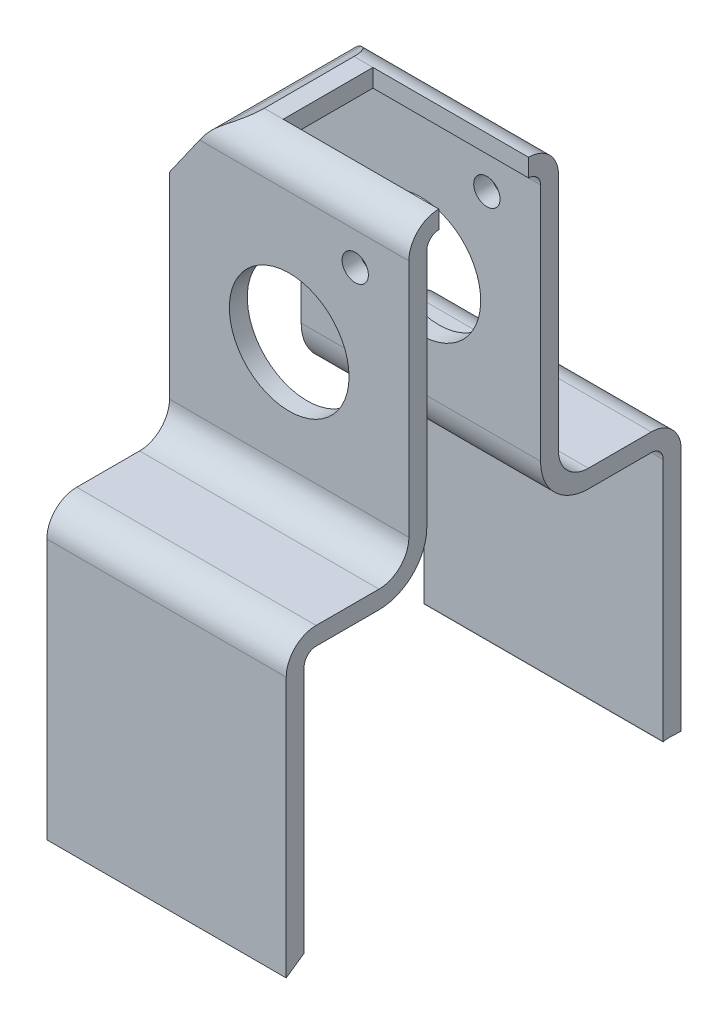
ISO-10303-21;
HEADER;
FILE_DESCRIPTION(('STEP AP214'),'2;1');
FILE_NAME('part.step','',(''),(''),'','','');
FILE_SCHEMA(('AUTOMOTIVE_DESIGN { 1 0 10303 214 1 1 1 1 }'));
ENDSEC;
DATA;
#1=APPLICATION_CONTEXT('core data for automotive mechanical design processes');
#2=APPLICATION_PROTOCOL_DEFINITION('international standard','automotive_design',2000,#1);
#3=PRODUCT_CONTEXT('',#1,'mechanical');
#4=PRODUCT('Part','Part','',(#3));
#5=PRODUCT_RELATED_PRODUCT_CATEGORY('part','',(#4));
#6=PRODUCT_DEFINITION_FORMATION('','',#4);
#7=PRODUCT_DEFINITION_CONTEXT('part definition',#1,'design');
#8=PRODUCT_DEFINITION('design','',#6,#7);
#9=PRODUCT_DEFINITION_SHAPE('','',#8);
#10=(LENGTH_UNIT() NAMED_UNIT(*) SI_UNIT(.MILLI.,.METRE.));
#11=(NAMED_UNIT(*) PLANE_ANGLE_UNIT() SI_UNIT($,.RADIAN.));
#12=(NAMED_UNIT(*) SI_UNIT($,.STERADIAN.) SOLID_ANGLE_UNIT());
#13=UNCERTAINTY_MEASURE_WITH_UNIT(LENGTH_MEASURE(1.E-05),#10,'distance_accuracy_value','');
#14=(GEOMETRIC_REPRESENTATION_CONTEXT(3) GLOBAL_UNCERTAINTY_ASSIGNED_CONTEXT((#13)) GLOBAL_UNIT_ASSIGNED_CONTEXT((#10,
#11,#12)) REPRESENTATION_CONTEXT('',''));
#15=CARTESIAN_POINT('',(0.,0.,0.));
#16=DIRECTION('',(0.,0.,1.));
#17=DIRECTION('',(1.,0.,0.));
#18=AXIS2_PLACEMENT_3D('',#15,#16,#17);
#19=CARTESIAN_POINT('',(40.,62.13081232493,13.3918767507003));
#20=DIRECTION('',(0.,-1.,0.));
#21=DIRECTION('',(0.,0.,-1.));
#22=AXIS2_PLACEMENT_3D('',#19,#20,#21);
#23=PLANE('',#22);
#24=DIRECTION('',(0.,0.,-1.));
#25=VECTOR('',#24,1.);
#26=CARTESIAN_POINT('',(10.8340774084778,62.13081232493,13.3918767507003));
#27=LINE('',#26,#25);
#28=CARTESIAN_POINT('',(10.8340774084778,62.13081232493,13.3918767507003));
#29=VERTEX_POINT('',#28);
#30=CARTESIAN_POINT('',(10.8340774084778,62.13081232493,-1.60812324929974));
#31=VERTEX_POINT('',#30);
#32=EDGE_CURVE('E679',#29,#31,#27,.T.);
#33=ORIENTED_EDGE('',*,*,#32,.F.);
#34=DIRECTION('',(-1.,0.,0.));
#35=VECTOR('',#34,1.);
#36=CARTESIAN_POINT('',(40.,62.13081232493,13.3918767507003));
#37=LINE('',#36,#35);
#38=CARTESIAN_POINT('',(14.,62.13081232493,13.3918767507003));
#39=VERTEX_POINT('',#38);
#40=EDGE_CURVE('E760',#39,#29,#37,.T.);
#41=ORIENTED_EDGE('',*,*,#40,.F.);
#42=DIRECTION('',(0.,0.,1.));
#43=VECTOR('',#42,1.);
#44=CARTESIAN_POINT('',(14.,62.13081232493,13.3918767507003));
#45=LINE('',#44,#43);
#46=CARTESIAN_POINT('',(14.,62.13081232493,-1.60812324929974));
#47=VERTEX_POINT('',#46);
#48=EDGE_CURVE('E894',#47,#39,#45,.T.);
#49=ORIENTED_EDGE('',*,*,#48,.F.);
#50=DIRECTION('',(-1.,0.,0.));
#51=VECTOR('',#50,1.);
#52=CARTESIAN_POINT('',(40.,62.13081232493,-1.60812324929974));
#53=LINE('',#52,#51);
#54=EDGE_CURVE('E764',#47,#31,#53,.T.);
#55=ORIENTED_EDGE('',*,*,#54,.T.);
#56=EDGE_LOOP('',(#33,#41,#49,#55));
#57=FACE_BOUND('',#56,.T.);
#58=ADVANCED_FACE('F355',(#57),#23,.F.);
#59=CARTESIAN_POINT('',(0.,59.13081232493,-1.60812324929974));
#60=DIRECTION('',(0.,1.,0.));
#61=DIRECTION('',(0.,0.,1.));
#62=AXIS2_PLACEMENT_3D('',#59,#60,#61);
#63=PLANE('',#62);
#64=DIRECTION('',(0.,0.,1.));
#65=VECTOR('',#64,1.);
#66=CARTESIAN_POINT('',(6.62023661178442,59.1308123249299,-169.297162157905));
#67=LINE('',#66,#65);
#68=CARTESIAN_POINT('',(6.62023661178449,59.13081232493,-1.60812324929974));
#69=VERTEX_POINT('',#68);
#70=CARTESIAN_POINT('',(6.6202366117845,59.13081232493,13.3918767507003));
#71=VERTEX_POINT('',#70);
#72=EDGE_CURVE('E639',#69,#71,#67,.T.);
#73=ORIENTED_EDGE('',*,*,#72,.F.);
#74=DIRECTION('',(1.,0.,0.));
#75=VECTOR('',#74,1.);
#76=CARTESIAN_POINT('',(0.,59.13081232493,-1.60812324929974));
#77=LINE('',#76,#75);
#78=CARTESIAN_POINT('',(14.,59.13081232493,-1.60812324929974));
#79=VERTEX_POINT('',#78);
#80=EDGE_CURVE('E593',#69,#79,#77,.T.);
#81=ORIENTED_EDGE('',*,*,#80,.T.);
#82=DIRECTION('',(0.,0.,-1.));
#83=VECTOR('',#82,1.);
#84=CARTESIAN_POINT('',(14.,59.13081232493,-1.60812324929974));
#85=LINE('',#84,#83);
#86=CARTESIAN_POINT('',(14.,59.13081232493,13.3918767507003));
#87=VERTEX_POINT('',#86);
#88=EDGE_CURVE('E899',#87,#79,#85,.T.);
#89=ORIENTED_EDGE('',*,*,#88,.F.);
#90=DIRECTION('',(1.,0.,0.));
#91=VECTOR('',#90,1.);
#92=CARTESIAN_POINT('',(0.,59.13081232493,13.3918767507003));
#93=LINE('',#92,#91);
#94=EDGE_CURVE('E1032',#71,#87,#93,.T.);
#95=ORIENTED_EDGE('',*,*,#94,.F.);
#96=EDGE_LOOP('',(#73,#81,#89,#95));
#97=FACE_BOUND('',#96,.T.);
#98=ADVANCED_FACE('F690',(#97),#63,.F.);
#99=CARTESIAN_POINT('',(40.,57.13081232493,-6.60812324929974));
#100=DIRECTION('',(0.,0.,1.));
#101=DIRECTION('',(0.,-1.,0.));
#102=AXIS2_PLACEMENT_3D('',#99,#100,#101);
#103=PLANE('',#102);
#104=CARTESIAN_POINT('',(31.0331198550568,51.6836947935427,-6.60812324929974));
#105=DIRECTION('',(0.,0.,1.));
#106=DIRECTION('',(0.,-1.,0.));
#107=AXIS2_PLACEMENT_3D('',#104,#105,#106);
#108=CIRCLE('',#107,2.20000000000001);
#109=CARTESIAN_POINT('',(31.0331198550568,49.4836947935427,-6.60812324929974));
#110=VERTEX_POINT('',#109);
#111=EDGE_CURVE('E615',#110,#110,#108,.T.);
#112=ORIENTED_EDGE('',*,*,#111,.T.);
#113=EDGE_LOOP('',(#112));
#114=FACE_BOUND('',#113,.T.);
#115=CARTESIAN_POINT('',(20.,35.3728388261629,-6.60812324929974));
#116=DIRECTION('',(0.,0.,1.));
#117=DIRECTION('',(0.,-1.,0.));
#118=AXIS2_PLACEMENT_3D('',#115,#116,#117);
#119=CIRCLE('',#118,10.);
#120=CARTESIAN_POINT('',(20.,25.3728388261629,-6.60812324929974));
#121=VERTEX_POINT('',#120);
#122=EDGE_CURVE('E1053',#121,#121,#119,.T.);
#123=ORIENTED_EDGE('',*,*,#122,.T.);
#124=EDGE_LOOP('',(#123));
#125=FACE_BOUND('',#124,.T.);
#126=DIRECTION('',(-0.575270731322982,-0.817963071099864,0.));
#127=VECTOR('',#126,1.);
#128=CARTESIAN_POINT('',(16.5993403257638,73.5884191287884,-6.60812324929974));
#129=LINE('',#128,#127);
#130=CARTESIAN_POINT('',(5.02475971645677,57.13081232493,-6.60812324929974));
#131=VERTEX_POINT('',#130);
#132=CARTESIAN_POINT('',(0.,49.986232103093,-6.60812324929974));
#133=VERTEX_POINT('',#132);
#134=EDGE_CURVE('E622',#131,#133,#129,.T.);
#135=ORIENTED_EDGE('',*,*,#134,.F.);
#136=DIRECTION('',(-1.,0.,0.));
#137=VECTOR('',#136,1.);
#138=CARTESIAN_POINT('',(40.,57.13081232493,-6.60812324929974));
#139=LINE('',#138,#137);
#140=CARTESIAN_POINT('',(40.,57.13081232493,-6.60812324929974));
#141=VERTEX_POINT('',#140);
#142=EDGE_CURVE('E768',#141,#131,#139,.T.);
#143=ORIENTED_EDGE('',*,*,#142,.F.);
#144=DIRECTION('',(0.,1.,0.));
#145=VECTOR('',#144,1.);
#146=CARTESIAN_POINT('',(40.,57.13081232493,-6.60812324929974));
#147=LINE('',#146,#145);
#148=CARTESIAN_POINT('',(40.,17.13081232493,-6.60812324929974));
#149=VERTEX_POINT('',#148);
#150=EDGE_CURVE('E736',#149,#141,#147,.T.);
#151=ORIENTED_EDGE('',*,*,#150,.F.);
#152=DIRECTION('',(-1.,0.,0.));
#153=VECTOR('',#152,1.);
#154=CARTESIAN_POINT('',(40.,17.13081232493,-6.60812324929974));
#155=LINE('',#154,#153);
#156=CARTESIAN_POINT('',(0.,17.13081232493,-6.60812324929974));
#157=VERTEX_POINT('',#156);
#158=EDGE_CURVE('E770',#149,#157,#155,.T.);
#159=ORIENTED_EDGE('',*,*,#158,.T.);
#160=DIRECTION('',(0.,1.,0.));
#161=VECTOR('',#160,1.);
#162=CARTESIAN_POINT('',(0.,57.13081232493,-6.60812324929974));
#163=LINE('',#162,#161);
#164=EDGE_CURVE('E847',#157,#133,#163,.T.);
#165=ORIENTED_EDGE('',*,*,#164,.T.);
#166=EDGE_LOOP('',(#135,#143,#151,#159,#165));
#167=FACE_BOUND('',#166,.T.);
#168=ADVANCED_FACE('F687',(#114,#125,#167),#103,.F.);
#169=CARTESIAN_POINT('',(40.,57.13081232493,-1.60812324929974));
#170=DIRECTION('',(-1.,0.,0.));
#171=DIRECTION('',(0.,0.,1.));
#172=AXIS2_PLACEMENT_3D('',#169,#170,#171);
#173=CYLINDRICAL_SURFACE('',#172,5.00000000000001);
#174=CARTESIAN_POINT('',(3.18701858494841,57.13081232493,-1.60812324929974));
#175=DIRECTION('',(-0.547249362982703,0.836969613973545,0.));
#176=DIRECTION('',(-0.836969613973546,-0.547249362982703,0.));
#177=AXIS2_PLACEMENT_3D('',#174,#175,#176);
#178=ELLIPSE('',#177,9.13660268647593,5.00000000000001);
#179=CARTESIAN_POINT('',(8.19367933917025,60.4043982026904,-5.38749297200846));
#180=VERTEX_POINT('',#179);
#181=EDGE_CURVE('E996',#31,#180,#178,.T.);
#182=ORIENTED_EDGE('',*,*,#181,.F.);
#183=ORIENTED_EDGE('',*,*,#54,.F.);
#184=CARTESIAN_POINT('',(40.,62.13081232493,-1.60812324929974));
#185=VERTEX_POINT('',#184);
#186=EDGE_CURVE('E765',#185,#47,#53,.T.);
#187=ORIENTED_EDGE('',*,*,#186,.F.);
#188=CARTESIAN_POINT('',(40.,57.13081232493,-1.60812324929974));
#189=DIRECTION('',(1.,0.,0.));
#190=DIRECTION('',(0.,0.,1.));
#191=AXIS2_PLACEMENT_3D('',#188,#189,#190);
#192=CIRCLE('',#191,5.00000000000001);
#193=EDGE_CURVE('E738',#141,#185,#192,.T.);
#194=ORIENTED_EDGE('',*,*,#193,.F.);
#195=ORIENTED_EDGE('',*,*,#142,.T.);
#196=CARTESIAN_POINT('',(5.02475971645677,57.13081232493,-1.60812324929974));
#197=DIRECTION('',(-0.817963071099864,0.575270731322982,0.));
#198=DIRECTION('',(-0.575270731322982,-0.817963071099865,0.));
#199=AXIS2_PLACEMENT_3D('',#196,#197,#198);
#200=ELLIPSE('',#199,6.11274539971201,5.00000000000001);
#201=CARTESIAN_POINT('',(5.48654225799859,57.7874093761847,-6.56482379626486));
#202=VERTEX_POINT('',#201);
#203=EDGE_CURVE('E376',#202,#131,#200,.T.);
#204=ORIENTED_EDGE('',*,*,#203,.F.);
#205=CARTESIAN_POINT('',(8.19367933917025,60.4043982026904,-5.38749297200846));
#206=CARTESIAN_POINT('',(8.03276169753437,60.2991772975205,-5.47861156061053));
#207=CARTESIAN_POINT('',(7.87363880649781,60.1885147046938,-5.56679150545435));
#208=CARTESIAN_POINT('',(7.55944548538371,59.955949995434,-5.73599894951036));
#209=CARTESIAN_POINT('',(7.40438146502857,59.8340313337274,-5.81701556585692));
#210=CARTESIAN_POINT('',(7.10228447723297,59.5814455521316,-5.96881765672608));
#211=CARTESIAN_POINT('',(6.95515316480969,59.4510003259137,-6.03977439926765));
#212=CARTESIAN_POINT('',(6.66665327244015,59.1793483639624,-6.17170696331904));
#213=CARTESIAN_POINT('',(6.52528078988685,59.0381491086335,-6.23268963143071));
#214=CARTESIAN_POINT('',(6.22783672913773,58.7223851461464,-6.35149198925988));
#215=CARTESIAN_POINT('',(6.07285851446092,58.5460323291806,-6.40737509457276));
#216=CARTESIAN_POINT('',(5.84757828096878,58.2703974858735,-6.47746364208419));
#217=CARTESIAN_POINT('',(5.77327588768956,58.1760922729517,-6.49861850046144));
#218=CARTESIAN_POINT('',(5.62762639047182,57.9841804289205,-6.53573044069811));
#219=CARTESIAN_POINT('',(5.5562803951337,57.8865725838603,-6.55168558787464));
#220=CARTESIAN_POINT('',(5.48654225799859,57.7874093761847,-6.56482379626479));
#221=B_SPLINE_CURVE_WITH_KNOTS('',3,(#205,#206,#207,#208,#209,#210,#211,#212,#213,#214,#215,
#216,#217,#218,#219,#220),.UNSPECIFIED.,.F.,.F.,(4,2,2,2,2,2,2,4),(0.,0.638306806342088,
1.27756726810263,1.90412909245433,2.53025899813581,3.25290476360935,3.61846427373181,
3.98415964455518),.UNSPECIFIED.);
#222=EDGE_CURVE('E371',#180,#202,#221,.T.);
#223=ORIENTED_EDGE('',*,*,#222,.F.);
#224=EDGE_LOOP('',(#182,#183,#187,#194,#195,#204,#223));
#225=FACE_BOUND('',#224,.T.);
#226=ADVANCED_FACE('F681',(#225),#173,.T.);
#227=CARTESIAN_POINT('',(40.,57.13081232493,13.3918767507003));
#228=DIRECTION('',(-1.,0.,0.));
#229=DIRECTION('',(0.,0.,1.));
#230=AXIS2_PLACEMENT_3D('',#227,#228,#229);
#231=CYLINDRICAL_SURFACE('',#230,5.);
#232=CARTESIAN_POINT('',(3.18701858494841,57.13081232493,13.3918767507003));
#233=DIRECTION('',(-0.547249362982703,0.836969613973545,0.));
#234=DIRECTION('',(-0.836969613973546,-0.547249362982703,0.));
#235=AXIS2_PLACEMENT_3D('',#232,#233,#234);
#236=ELLIPSE('',#235,9.13660268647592,5.);
#237=CARTESIAN_POINT('',(8.19367933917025,60.4043982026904,17.171246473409));
#238=VERTEX_POINT('',#237);
#239=EDGE_CURVE('E11',#238,#29,#236,.T.);
#240=ORIENTED_EDGE('',*,*,#239,.F.);
#241=CARTESIAN_POINT('',(5.48654225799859,57.7874093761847,18.3485772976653));
#242=CARTESIAN_POINT('',(5.60959970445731,57.9624426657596,18.3253720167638));
#243=CARTESIAN_POINT('',(5.73766858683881,58.1325468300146,18.2934298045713));
#244=CARTESIAN_POINT('',(6.00227723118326,58.4619145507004,18.2144109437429));
#245=CARTESIAN_POINT('',(6.13880330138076,58.621194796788,18.167358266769));
#246=CARTESIAN_POINT('',(6.41668907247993,58.9257688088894,18.061317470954));
#247=CARTESIAN_POINT('',(6.55792037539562,59.0712602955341,18.0025554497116));
#248=CARTESIAN_POINT('',(6.84641290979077,59.351208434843,17.87445800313));
#249=CARTESIAN_POINT('',(6.9936753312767,59.4856628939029,17.8051204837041));
#250=CARTESIAN_POINT('',(7.31183574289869,59.7594513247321,17.6484182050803));
#251=CARTESIAN_POINT('',(7.48340386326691,59.897331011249,17.5598844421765));
#252=CARTESIAN_POINT('',(7.83375473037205,60.1606714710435,17.372611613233));
#253=CARTESIAN_POINT('',(8.01259341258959,60.2859904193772,17.273777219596));
#254=CARTESIAN_POINT('',(8.19367933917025,60.4043982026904,17.171246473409));
#255=B_SPLINE_CURVE_WITH_KNOTS('',3,(#241,#242,#243,#244,#245,#246,#247,#248,#249,#250,#251,
#252,#253,#254),.UNSPECIFIED.,.F.,.F.,(4,2,2,2,2,2,4),(0.,0.64507015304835,1.28912196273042,
1.92176936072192,2.55454219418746,3.26560018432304,3.98394862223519),.UNSPECIFIED.);
#256=CARTESIAN_POINT('',(5.48654225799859,57.7874093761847,18.3485772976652));
#257=VERTEX_POINT('',#256);
#258=EDGE_CURVE('E649',#257,#238,#255,.T.);
#259=ORIENTED_EDGE('',*,*,#258,.F.);
#260=CARTESIAN_POINT('',(5.02475971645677,57.13081232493,13.3918767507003));
#261=DIRECTION('',(-0.817963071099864,0.575270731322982,0.));
#262=DIRECTION('',(-0.575270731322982,-0.817963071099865,0.));
#263=AXIS2_PLACEMENT_3D('',#260,#261,#262);
#264=ELLIPSE('',#263,6.11274539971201,5.);
#265=CARTESIAN_POINT('',(5.02475971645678,57.13081232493,18.3918767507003));
#266=VERTEX_POINT('',#265);
#267=EDGE_CURVE('E636',#266,#257,#264,.T.);
#268=ORIENTED_EDGE('',*,*,#267,.F.);
#269=DIRECTION('',(-1.,0.,0.));
#270=VECTOR('',#269,1.);
#271=CARTESIAN_POINT('',(40.,57.13081232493,18.3918767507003));
#272=LINE('',#271,#270);
#273=CARTESIAN_POINT('',(40.,57.13081232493,18.3918767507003));
#274=VERTEX_POINT('',#273);
#275=EDGE_CURVE('E757',#274,#266,#272,.T.);
#276=ORIENTED_EDGE('',*,*,#275,.F.);
#277=CARTESIAN_POINT('',(40.,57.13081232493,13.3918767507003));
#278=DIRECTION('',(1.,0.,0.));
#279=DIRECTION('',(0.,0.,-1.));
#280=AXIS2_PLACEMENT_3D('',#277,#278,#279);
#281=CIRCLE('',#280,5.);
#282=CARTESIAN_POINT('',(40.,62.13081232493,13.3918767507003));
#283=VERTEX_POINT('',#282);
#284=EDGE_CURVE('E740',#283,#274,#281,.T.);
#285=ORIENTED_EDGE('',*,*,#284,.F.);
#286=EDGE_CURVE('E761',#283,#39,#37,.T.);
#287=ORIENTED_EDGE('',*,*,#286,.T.);
#288=ORIENTED_EDGE('',*,*,#40,.T.);
#289=EDGE_LOOP('',(#240,#259,#268,#276,#285,#287,#288));
#290=FACE_BOUND('',#289,.T.);
#291=ADVANCED_FACE('F686',(#290),#231,.T.);
#292=CARTESIAN_POINT('',(40.,57.13081232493,18.3918767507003));
#293=DIRECTION('',(0.,0.,-1.));
#294=DIRECTION('',(0.,1.,0.));
#295=AXIS2_PLACEMENT_3D('',#292,#293,#294);
#296=PLANE('',#295);
#297=CARTESIAN_POINT('',(31.0331198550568,51.6836947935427,18.3918767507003));
#298=DIRECTION('',(0.,0.,1.));
#299=DIRECTION('',(1.,0.,0.));
#300=AXIS2_PLACEMENT_3D('',#297,#298,#299);
#301=CIRCLE('',#300,2.20000000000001);
#302=CARTESIAN_POINT('',(33.2331198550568,51.6836947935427,18.3918767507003));
#303=VERTEX_POINT('',#302);
#304=EDGE_CURVE('E1281',#303,#303,#301,.T.);
#305=ORIENTED_EDGE('',*,*,#304,.F.);
#306=EDGE_LOOP('',(#305));
#307=FACE_BOUND('',#306,.T.);
#308=CARTESIAN_POINT('',(20.,35.3728388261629,18.3918767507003));
#309=DIRECTION('',(0.,0.,1.));
#310=DIRECTION('',(1.,0.,0.));
#311=AXIS2_PLACEMENT_3D('',#308,#309,#310);
#312=CIRCLE('',#311,10.);
#313=CARTESIAN_POINT('',(30.,35.3728388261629,18.3918767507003));
#314=VERTEX_POINT('',#313);
#315=EDGE_CURVE('E820',#314,#314,#312,.T.);
#316=ORIENTED_EDGE('',*,*,#315,.F.);
#317=EDGE_LOOP('',(#316));
#318=FACE_BOUND('',#317,.T.);
#319=DIRECTION('',(0.575270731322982,0.817963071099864,0.));
#320=VECTOR('',#319,1.);
#321=CARTESIAN_POINT('',(16.5993403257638,73.5884191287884,18.3918767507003));
#322=LINE('',#321,#320);
#323=CARTESIAN_POINT('',(0.,49.986232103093,18.3918767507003));
#324=VERTEX_POINT('',#323);
#325=EDGE_CURVE('E633',#324,#266,#322,.T.);
#326=ORIENTED_EDGE('',*,*,#325,.F.);
#327=DIRECTION('',(0.,-1.,0.));
#328=VECTOR('',#327,1.);
#329=CARTESIAN_POINT('',(0.,57.13081232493,18.3918767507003));
#330=LINE('',#329,#328);
#331=CARTESIAN_POINT('',(0.,17.13081232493,18.3918767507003));
#332=VERTEX_POINT('',#331);
#333=EDGE_CURVE('E850',#324,#332,#330,.T.);
#334=ORIENTED_EDGE('',*,*,#333,.T.);
#335=DIRECTION('',(-1.,0.,0.));
#336=VECTOR('',#335,1.);
#337=CARTESIAN_POINT('',(40.,17.13081232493,18.3918767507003));
#338=LINE('',#337,#336);
#339=CARTESIAN_POINT('',(40.,17.13081232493,18.3918767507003));
#340=VERTEX_POINT('',#339);
#341=EDGE_CURVE('E754',#340,#332,#338,.T.);
#342=ORIENTED_EDGE('',*,*,#341,.F.);
#343=DIRECTION('',(0.,-1.,0.));
#344=VECTOR('',#343,1.);
#345=CARTESIAN_POINT('',(40.,57.13081232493,18.3918767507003));
#346=LINE('',#345,#344);
#347=EDGE_CURVE('E742',#274,#340,#346,.T.);
#348=ORIENTED_EDGE('',*,*,#347,.F.);
#349=ORIENTED_EDGE('',*,*,#275,.T.);
#350=EDGE_LOOP('',(#326,#334,#342,#348,#349));
#351=FACE_BOUND('',#350,.T.);
#352=ADVANCED_FACE('F968',(#307,#318,#351),#296,.F.);
#353=CARTESIAN_POINT('',(0.,7.13081232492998,33.8918767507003));
#354=DIRECTION('',(-1.,0.,0.));
#355=DIRECTION('',(0.,0.,1.));
#356=AXIS2_PLACEMENT_3D('',#353,#354,#355);
#357=PLANE('',#356);
#358=ORIENTED_EDGE('',*,*,#333,.F.);
#359=DIRECTION('',(0.,0.,-1.));
#360=VECTOR('',#359,1.);
#361=CARTESIAN_POINT('',(0.,49.986232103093,33.8918767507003));
#362=LINE('',#361,#360);
#363=CARTESIAN_POINT('',(0.,49.986232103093,15.3918767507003));
#364=VERTEX_POINT('',#363);
#365=EDGE_CURVE('E623',#324,#364,#362,.T.);
#366=ORIENTED_EDGE('',*,*,#365,.T.);
#367=DIRECTION('',(0.,-1.,0.));
#368=VECTOR('',#367,1.);
#369=CARTESIAN_POINT('',(0.,57.13081232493,15.3918767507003));
#370=LINE('',#369,#368);
#371=CARTESIAN_POINT('',(0.,17.13081232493,15.3918767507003));
#372=VERTEX_POINT('',#371);
#373=EDGE_CURVE('E1144',#364,#372,#370,.T.);
#374=ORIENTED_EDGE('',*,*,#373,.T.);
#375=CARTESIAN_POINT('',(0.,17.13081232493,23.3918767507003));
#376=DIRECTION('',(-1.,0.,0.));
#377=DIRECTION('',(0.,0.,-1.));
#378=AXIS2_PLACEMENT_3D('',#375,#376,#377);
#379=CIRCLE('',#378,8.);
#380=CARTESIAN_POINT('',(0.,9.13081232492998,23.3918767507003));
#381=VERTEX_POINT('',#380);
#382=EDGE_CURVE('E1087',#372,#381,#379,.T.);
#383=ORIENTED_EDGE('',*,*,#382,.T.);
#384=DIRECTION('',(0.,0.,1.));
#385=VECTOR('',#384,1.);
#386=CARTESIAN_POINT('',(0.,9.13081232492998,23.3918767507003));
#387=LINE('',#386,#385);
#388=CARTESIAN_POINT('',(0.,9.13081232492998,33.8918767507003));
#389=VERTEX_POINT('',#388);
#390=EDGE_CURVE('E1147',#381,#389,#387,.T.);
#391=ORIENTED_EDGE('',*,*,#390,.T.);
#392=CARTESIAN_POINT('',(0.,7.13081232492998,33.8918767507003));
#393=DIRECTION('',(1.,0.,0.));
#394=DIRECTION('',(0.,0.,-1.));
#395=AXIS2_PLACEMENT_3D('',#392,#393,#394);
#396=CIRCLE('',#395,2.);
#397=CARTESIAN_POINT('',(0.,7.13081232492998,35.8918767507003));
#398=VERTEX_POINT('',#397);
#399=EDGE_CURVE('E1072',#389,#398,#396,.T.);
#400=ORIENTED_EDGE('',*,*,#399,.T.);
#401=DIRECTION('',(0.,-1.,0.));
#402=VECTOR('',#401,1.);
#403=CARTESIAN_POINT('',(0.,7.13081232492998,35.8918767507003));
#404=LINE('',#403,#402);
#405=CARTESIAN_POINT('',(0.,-34.3053961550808,35.8918767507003));
#406=VERTEX_POINT('',#405);
#407=EDGE_CURVE('E1048',#398,#406,#404,.T.);
#408=ORIENTED_EDGE('',*,*,#407,.T.);
#409=CARTESIAN_POINT('',(0.,-36.3924369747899,38.8918767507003));
#410=CARTESIAN_POINT('',(0.,-33.9748807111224,35.5332393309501));
#411=CARTESIAN_POINT('',(0.,-29.182731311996,28.8756518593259));
#412=CARTESIAN_POINT('',(0.,-44.5793561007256,23.2811329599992));
#413=CARTESIAN_POINT('',(0.,-42.1217881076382,5.05168401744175));
#414=CARTESIAN_POINT('',(0.,-26.7424329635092,-6.29397874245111));
#415=CARTESIAN_POINT('',(0.,-37.3909880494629,-18.4954620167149));
#416=CARTESIAN_POINT('',(0.,-33.3621463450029,-24.0678627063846));
#417=CARTESIAN_POINT('',(0.,-33.6642904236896,-26.0372015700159));
#418=CARTESIAN_POINT('',(0.,-33.654940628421,-26.9417797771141));
#419=CARTESIAN_POINT('',(0.,-33.6532212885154,-27.1081232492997));
#420=B_SPLINE_CURVE_WITH_KNOTS('',3,(#409,#410,#411,#412,#413,#414,#415,#416,#417,#418,#419),
.UNSPECIFIED.,.F.,.F.,(4,1,1,1,1,1,1,1,4),(0.,0.13644398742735,0.270463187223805,
0.49993459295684,0.732834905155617,0.921346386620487,0.96272680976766,0.993145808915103,1.),.UNSPECIFIED.);
#421=CARTESIAN_POINT('',(0.,-36.3924369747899,38.8918767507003));
#422=VERTEX_POINT('',#421);
#423=EDGE_CURVE('E827',#422,#406,#420,.T.);
#424=ORIENTED_EDGE('',*,*,#423,.F.);
#425=DIRECTION('',(0.,-1.,0.));
#426=VECTOR('',#425,1.);
#427=CARTESIAN_POINT('',(0.,7.13081232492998,38.8918767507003));
#428=LINE('',#427,#426);
#429=CARTESIAN_POINT('',(0.,7.13081232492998,38.8918767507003));
#430=VERTEX_POINT('',#429);
#431=EDGE_CURVE('E828',#430,#422,#428,.T.);
#432=ORIENTED_EDGE('',*,*,#431,.F.);
#433=CARTESIAN_POINT('',(0.,7.13081232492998,33.8918767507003));
#434=DIRECTION('',(1.,0.,0.));
#435=DIRECTION('',(0.,0.,1.));
#436=AXIS2_PLACEMENT_3D('',#433,#434,#435);
#437=CIRCLE('',#436,5.);
#438=CARTESIAN_POINT('',(0.,12.13081232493,33.8918767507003));
#439=VERTEX_POINT('',#438);
#440=EDGE_CURVE('E831',#439,#430,#437,.T.);
#441=ORIENTED_EDGE('',*,*,#440,.F.);
#442=DIRECTION('',(0.,0.,1.));
#443=VECTOR('',#442,1.);
#444=CARTESIAN_POINT('',(0.,12.13081232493,33.8918767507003));
#445=LINE('',#444,#443);
#446=CARTESIAN_POINT('',(0.,12.13081232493,23.3918767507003));
#447=VERTEX_POINT('',#446);
#448=EDGE_CURVE('E854',#447,#439,#445,.T.);
#449=ORIENTED_EDGE('',*,*,#448,.F.);
#450=CARTESIAN_POINT('',(0.,17.13081232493,23.3918767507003));
#451=DIRECTION('',(-1.,0.,0.));
#452=DIRECTION('',(0.,0.,1.));
#453=AXIS2_PLACEMENT_3D('',#450,#451,#452);
#454=CIRCLE('',#453,5.);
#455=EDGE_CURVE('E852',#332,#447,#454,.T.);
#456=ORIENTED_EDGE('',*,*,#455,.F.);
#457=EDGE_LOOP('',(#358,#366,#374,#383,#391,#400,#408,#424,#432,#441,#449,#456));
#458=FACE_BOUND('',#457,.T.);
#459=ADVANCED_FACE('F965',(#458),#357,.T.);
#460=DIRECTION('',(0.,1.,0.));
#461=VECTOR('',#460,1.);
#462=CARTESIAN_POINT('',(0.,17.13081232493,-3.60812324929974));
#463=LINE('',#462,#461);
#464=CARTESIAN_POINT('',(0.,17.13081232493,-3.60812324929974));
#465=VERTEX_POINT('',#464);
#466=CARTESIAN_POINT('',(0.,49.986232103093,-3.60812324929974));
#467=VERTEX_POINT('',#466);
#468=EDGE_CURVE('E1142',#465,#467,#463,.T.);
#469=ORIENTED_EDGE('',*,*,#468,.T.);
#470=EDGE_CURVE('E620',#467,#133,#362,.T.);
#471=ORIENTED_EDGE('',*,*,#470,.T.);
#472=ORIENTED_EDGE('',*,*,#164,.F.);
#473=CARTESIAN_POINT('',(0.,17.13081232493,-11.6081232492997));
#474=DIRECTION('',(-1.,0.,0.));
#475=DIRECTION('',(0.,0.,1.));
#476=AXIS2_PLACEMENT_3D('',#473,#474,#475);
#477=CIRCLE('',#476,5.);
#478=CARTESIAN_POINT('',(0.,12.13081232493,-11.6081232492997));
#479=VERTEX_POINT('',#478);
#480=EDGE_CURVE('E845',#479,#157,#477,.T.);
#481=ORIENTED_EDGE('',*,*,#480,.F.);
#482=DIRECTION('',(0.,0.,1.));
#483=VECTOR('',#482,1.);
#484=CARTESIAN_POINT('',(0.,12.13081232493,-11.6081232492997));
#485=LINE('',#484,#483);
#486=CARTESIAN_POINT('',(0.,12.13081232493,-22.1081232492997));
#487=VERTEX_POINT('',#486);
#488=EDGE_CURVE('E843',#487,#479,#485,.T.);
#489=ORIENTED_EDGE('',*,*,#488,.F.);
#490=CARTESIAN_POINT('',(0.,7.13081232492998,-22.1081232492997));
#491=DIRECTION('',(1.,0.,0.));
#492=DIRECTION('',(0.,0.,-1.));
#493=AXIS2_PLACEMENT_3D('',#490,#491,#492);
#494=CIRCLE('',#493,5.);
#495=CARTESIAN_POINT('',(0.,7.13081232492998,-27.1081232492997));
#496=VERTEX_POINT('',#495);
#497=EDGE_CURVE('E841',#496,#487,#494,.T.);
#498=ORIENTED_EDGE('',*,*,#497,.F.);
#499=DIRECTION('',(0.,1.,0.));
#500=VECTOR('',#499,1.);
#501=CARTESIAN_POINT('',(0.,7.13081232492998,-27.1081232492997));
#502=LINE('',#501,#500);
#503=CARTESIAN_POINT('',(0.,-33.6532212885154,-27.1081232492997));
#504=VERTEX_POINT('',#503);
#505=EDGE_CURVE('E826',#504,#496,#502,.T.);
#506=ORIENTED_EDGE('',*,*,#505,.F.);
#507=CARTESIAN_POINT('',(0.,-33.7221393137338,-24.0929178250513));
#508=VERTEX_POINT('',#507);
#509=EDGE_CURVE('E819',#508,#504,#420,.T.);
#510=ORIENTED_EDGE('',*,*,#509,.F.);
#511=CARTESIAN_POINT('',(0.,-36.3924369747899,35.8918767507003));
#512=CARTESIAN_POINT('',(0.,-39.2021161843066,35.6192391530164));
#513=CARTESIAN_POINT('',(0.,-60.7520369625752,33.5281397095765));
#514=CARTESIAN_POINT('',(0.,-59.6247018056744,-18.3781311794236));
#515=CARTESIAN_POINT('',(0.,-37.5359454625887,-23.2514921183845));
#516=CARTESIAN_POINT('',(0.,-33.6532212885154,-24.1081232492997));
#517=B_SPLINE_CURVE_WITH_KNOTS('',3,(#511,#512,#513,#514,#515,#516),.UNSPECIFIED.,.F.,.F.,(4,1,
1,4),(0.,0.109982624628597,0.843554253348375,1.),.UNSPECIFIED.);
#518=CARTESIAN_POINT('',(0.,-33.6532212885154,-24.1081232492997));
#519=VERTEX_POINT('',#518);
#520=EDGE_CURVE('E605',#519,#508,#517,.F.);
#521=ORIENTED_EDGE('',*,*,#520,.F.);
#522=DIRECTION('',(0.,1.,0.));
#523=VECTOR('',#522,1.);
#524=CARTESIAN_POINT('',(0.,-33.6532212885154,-24.1081232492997));
#525=LINE('',#524,#523);
#526=CARTESIAN_POINT('',(0.,7.13081232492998,-24.1081232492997));
#527=VERTEX_POINT('',#526);
#528=EDGE_CURVE('E943',#519,#527,#525,.T.);
#529=ORIENTED_EDGE('',*,*,#528,.T.);
#530=CARTESIAN_POINT('',(0.,7.13081232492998,-22.1081232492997));
#531=DIRECTION('',(1.,0.,0.));
#532=DIRECTION('',(0.,0.,-1.));
#533=AXIS2_PLACEMENT_3D('',#530,#531,#532);
#534=CIRCLE('',#533,2.);
#535=CARTESIAN_POINT('',(0.,9.13081232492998,-22.1081232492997));
#536=VERTEX_POINT('',#535);
#537=EDGE_CURVE('E1138',#527,#536,#534,.T.);
#538=ORIENTED_EDGE('',*,*,#537,.T.);
#539=DIRECTION('',(0.,0.,1.));
#540=VECTOR('',#539,1.);
#541=CARTESIAN_POINT('',(0.,9.13081232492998,-22.1081232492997));
#542=LINE('',#541,#540);
#543=CARTESIAN_POINT('',(0.,9.13081232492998,-11.6081232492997));
#544=VERTEX_POINT('',#543);
#545=EDGE_CURVE('E1134',#536,#544,#542,.T.);
#546=ORIENTED_EDGE('',*,*,#545,.T.);
#547=CARTESIAN_POINT('',(0.,17.13081232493,-11.6081232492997));
#548=DIRECTION('',(-1.,0.,0.));
#549=DIRECTION('',(0.,0.,-1.));
#550=AXIS2_PLACEMENT_3D('',#547,#548,#549);
#551=CIRCLE('',#550,8.);
#552=EDGE_CURVE('E1137',#544,#465,#551,.T.);
#553=ORIENTED_EDGE('',*,*,#552,.T.);
#554=EDGE_LOOP('',(#469,#471,#472,#481,#489,#498,#506,#510,#521,#529,#538,#546,#553));
#555=FACE_BOUND('',#554,.T.);
#556=ADVANCED_FACE('F824',(#555),#357,.T.);
#557=CARTESIAN_POINT('',(0.,57.13081232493,15.3918767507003));
#558=DIRECTION('',(0.,0.,1.));
#559=DIRECTION('',(1.,0.,0.));
#560=AXIS2_PLACEMENT_3D('',#557,#558,#559);
#561=PLANE('',#560);
#562=CARTESIAN_POINT('',(31.0331198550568,51.6836947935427,15.3918767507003));
#563=DIRECTION('',(0.,0.,1.));
#564=DIRECTION('',(1.,0.,0.));
#565=AXIS2_PLACEMENT_3D('',#562,#563,#564);
#566=CIRCLE('',#565,2.20000000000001);
#567=CARTESIAN_POINT('',(33.2331198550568,51.6836947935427,15.3918767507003));
#568=VERTEX_POINT('',#567);
#569=EDGE_CURVE('E1284',#568,#568,#566,.T.);
#570=ORIENTED_EDGE('',*,*,#569,.T.);
#571=EDGE_LOOP('',(#570));
#572=FACE_BOUND('',#571,.T.);
#573=CARTESIAN_POINT('',(20.,35.3728388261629,15.3918767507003));
#574=DIRECTION('',(0.,0.,1.));
#575=DIRECTION('',(1.,0.,0.));
#576=AXIS2_PLACEMENT_3D('',#573,#574,#575);
#577=CIRCLE('',#576,10.);
#578=CARTESIAN_POINT('',(30.,35.3728388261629,15.3918767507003));
#579=VERTEX_POINT('',#578);
#580=EDGE_CURVE('E794',#579,#579,#577,.F.);
#581=ORIENTED_EDGE('',*,*,#580,.F.);
#582=EDGE_LOOP('',(#581));
#583=FACE_BOUND('',#582,.T.);
#584=DIRECTION('',(-0.575270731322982,-0.817963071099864,0.));
#585=VECTOR('',#584,1.);
#586=CARTESIAN_POINT('',(3.36188375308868,54.766410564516,15.3918767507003));
#587=LINE('',#586,#585);
#588=CARTESIAN_POINT('',(5.02475971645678,57.13081232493,15.3918767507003));
#589=VERTEX_POINT('',#588);
#590=EDGE_CURVE('E630',#589,#364,#587,.T.);
#591=ORIENTED_EDGE('',*,*,#590,.F.);
#592=DIRECTION('',(1.,0.,0.));
#593=VECTOR('',#592,1.);
#594=CARTESIAN_POINT('',(0.,57.13081232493,15.3918767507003));
#595=LINE('',#594,#593);
#596=CARTESIAN_POINT('',(40.,57.13081232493,15.3918767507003));
#597=VERTEX_POINT('',#596);
#598=EDGE_CURVE('E1089',#589,#597,#595,.T.);
#599=ORIENTED_EDGE('',*,*,#598,.T.);
#600=DIRECTION('',(0.,-1.,0.));
#601=VECTOR('',#600,1.);
#602=CARTESIAN_POINT('',(40.,57.13081232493,15.3918767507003));
#603=LINE('',#602,#601);
#604=CARTESIAN_POINT('',(40.,17.13081232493,15.3918767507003));
#605=VERTEX_POINT('',#604);
#606=EDGE_CURVE('E929',#597,#605,#603,.T.);
#607=ORIENTED_EDGE('',*,*,#606,.T.);
#608=DIRECTION('',(1.,0.,0.));
#609=VECTOR('',#608,1.);
#610=CARTESIAN_POINT('',(0.,17.13081232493,15.3918767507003));
#611=LINE('',#610,#609);
#612=EDGE_CURVE('E1085',#372,#605,#611,.T.);
#613=ORIENTED_EDGE('',*,*,#612,.F.);
#614=ORIENTED_EDGE('',*,*,#373,.F.);
#615=EDGE_LOOP('',(#591,#599,#607,#613,#614));
#616=FACE_BOUND('',#615,.T.);
#617=ADVANCED_FACE('F1091',(#572,#583,#616),#561,.F.);
#618=CARTESIAN_POINT('',(0.,17.13081232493,-3.60812324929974));
#619=DIRECTION('',(0.,0.,-1.));
#620=DIRECTION('',(0.,1.,0.));
#621=AXIS2_PLACEMENT_3D('',#618,#619,#620);
#622=PLANE('',#621);
#623=CARTESIAN_POINT('',(31.0331198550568,51.6836947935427,-3.60812324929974));
#624=DIRECTION('',(0.,0.,-1.));
#625=DIRECTION('',(0.,1.,0.));
#626=AXIS2_PLACEMENT_3D('',#623,#624,#625);
#627=CIRCLE('',#626,2.20000000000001);
#628=CARTESIAN_POINT('',(31.0331198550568,53.8836947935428,-3.60812324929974));
#629=VERTEX_POINT('',#628);
#630=EDGE_CURVE('E359',#629,#629,#627,.T.);
#631=ORIENTED_EDGE('',*,*,#630,.T.);
#632=EDGE_LOOP('',(#631));
#633=FACE_BOUND('',#632,.T.);
#634=CARTESIAN_POINT('',(20.,35.3728388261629,-3.60812324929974));
#635=DIRECTION('',(0.,0.,-1.));
#636=DIRECTION('',(0.,1.,0.));
#637=AXIS2_PLACEMENT_3D('',#634,#635,#636);
#638=CIRCLE('',#637,10.);
#639=CARTESIAN_POINT('',(20.,45.3728388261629,-3.60812324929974));
#640=VERTEX_POINT('',#639);
#641=EDGE_CURVE('E791',#640,#640,#638,.F.);
#642=ORIENTED_EDGE('',*,*,#641,.F.);
#643=EDGE_LOOP('',(#642));
#644=FACE_BOUND('',#643,.T.);
#645=DIRECTION('',(0.575270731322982,0.817963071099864,0.));
#646=VECTOR('',#645,1.);
#647=CARTESIAN_POINT('',(-15.4601248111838,28.0038671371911,-3.60812324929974));
#648=LINE('',#647,#646);
#649=CARTESIAN_POINT('',(5.02475971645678,57.13081232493,-3.60812324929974));
#650=VERTEX_POINT('',#649);
#651=EDGE_CURVE('E604',#467,#650,#648,.T.);
#652=ORIENTED_EDGE('',*,*,#651,.F.);
#653=ORIENTED_EDGE('',*,*,#468,.F.);
#654=DIRECTION('',(1.,0.,0.));
#655=VECTOR('',#654,1.);
#656=CARTESIAN_POINT('',(0.,17.13081232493,-3.60812324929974));
#657=LINE('',#656,#655);
#658=CARTESIAN_POINT('',(40.,17.13081232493,-3.60812324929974));
#659=VERTEX_POINT('',#658);
#660=EDGE_CURVE('E1035',#465,#659,#657,.T.);
#661=ORIENTED_EDGE('',*,*,#660,.T.);
#662=DIRECTION('',(0.,1.,0.));
#663=VECTOR('',#662,1.);
#664=CARTESIAN_POINT('',(40.,17.13081232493,-3.60812324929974));
#665=LINE('',#664,#663);
#666=CARTESIAN_POINT('',(40.,57.13081232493,-3.60812324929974));
#667=VERTEX_POINT('',#666);
#668=EDGE_CURVE('E921',#659,#667,#665,.T.);
#669=ORIENTED_EDGE('',*,*,#668,.T.);
#670=DIRECTION('',(1.,0.,0.));
#671=VECTOR('',#670,1.);
#672=CARTESIAN_POINT('',(0.,57.13081232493,-3.60812324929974));
#673=LINE('',#672,#671);
#674=EDGE_CURVE('E1034',#650,#667,#673,.T.);
#675=ORIENTED_EDGE('',*,*,#674,.F.);
#676=EDGE_LOOP('',(#652,#653,#661,#669,#675));
#677=FACE_BOUND('',#676,.T.);
#678=ADVANCED_FACE('F1095',(#633,#644,#677),#622,.F.);
#679=CARTESIAN_POINT('',(0.,57.13081232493,13.3918767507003));
#680=DIRECTION('',(1.,0.,0.));
#681=DIRECTION('',(0.,0.,-1.));
#682=AXIS2_PLACEMENT_3D('',#679,#680,#681);
#683=CYLINDRICAL_SURFACE('',#682,2.00000000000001);
#684=CARTESIAN_POINT('',(5.48654225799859,57.7874093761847,11.502728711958));
#685=CARTESIAN_POINT('',(5.53340689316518,57.8540606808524,11.5259073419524));
#686=CARTESIAN_POINT('',(5.58053574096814,57.919325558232,11.5525321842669));
#687=CARTESIAN_POINT('',(5.67483290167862,58.0467504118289,11.6125412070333));
#688=CARTESIAN_POINT('',(5.72200120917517,58.108907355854,11.6459318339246));
#689=CARTESIAN_POINT('',(5.81620064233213,58.2301753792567,11.7196104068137));
#690=CARTESIAN_POINT('',(5.86322708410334,58.2892555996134,11.7599553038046));
#691=CARTESIAN_POINT('',(5.95603330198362,58.4033088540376,11.8472384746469));
#692=CARTESIAN_POINT('',(6.00181371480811,58.4582840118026,11.8941733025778));
#693=CARTESIAN_POINT('',(6.11153987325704,58.5873760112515,12.0172599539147));
#694=CARTESIAN_POINT('',(6.17440573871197,58.6589955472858,12.0970643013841));
#695=CARTESIAN_POINT('',(6.29264878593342,58.7903604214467,12.2704174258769));
#696=CARTESIAN_POINT('',(6.34805125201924,58.8501461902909,12.3639174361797));
#697=CARTESIAN_POINT('',(6.43518338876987,58.9423645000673,12.5400481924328));
#698=CARTESIAN_POINT('',(6.46939452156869,58.977913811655,12.6198036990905));
#699=CARTESIAN_POINT('',(6.52881131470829,59.0389785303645,12.7862834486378));
#700=CARTESIAN_POINT('',(6.55402265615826,59.0645002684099,12.8730032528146));
#701=CARTESIAN_POINT('',(6.59323528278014,59.1039562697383,13.0524583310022));
#702=CARTESIAN_POINT('',(6.60713110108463,59.1177815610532,13.145241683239));
#703=CARTESIAN_POINT('',(6.62157231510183,59.132146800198,13.3328428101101));
#704=CARTESIAN_POINT('',(6.62212900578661,59.1326979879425,13.4276587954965));
#705=CARTESIAN_POINT('',(6.61073330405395,59.1213658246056,13.6022586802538));
#706=CARTESIAN_POINT('',(6.60052699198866,59.1112181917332,13.6822833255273));
#707=CARTESIAN_POINT('',(6.57122119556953,59.0818352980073,13.8389437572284));
#708=CARTESIAN_POINT('',(6.55211759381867,59.0625958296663,13.915577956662));
#709=CARTESIAN_POINT('',(6.49986267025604,59.0093522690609,14.0855261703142));
#710=CARTESIAN_POINT('',(6.46424512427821,58.9726856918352,14.1772417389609));
#711=CARTESIAN_POINT('',(6.38397932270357,58.8883907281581,14.3512028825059));
#712=CARTESIAN_POINT('',(6.33931328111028,58.8407407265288,14.4334292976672));
#713=CARTESIAN_POINT('',(6.2277503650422,58.7189184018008,14.6139390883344));
#714=CARTESIAN_POINT('',(6.15842774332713,58.6412149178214,14.7083285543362));
#715=CARTESIAN_POINT('',(6.01371302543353,58.4730418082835,14.8794381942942));
#716=CARTESIAN_POINT('',(5.93831238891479,58.3825540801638,14.9561328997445));
#717=CARTESIAN_POINT('',(5.79973248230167,58.2095629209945,15.0786688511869));
#718=CARTESIAN_POINT('',(5.73699278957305,58.1288726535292,15.1276072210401));
#719=CARTESIAN_POINT('',(5.61151906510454,57.9620557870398,15.2133429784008));
#720=CARTESIAN_POINT('',(5.54878676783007,57.8759602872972,15.2502033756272));
#721=CARTESIAN_POINT('',(5.4865422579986,57.7874093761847,15.2810247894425));
#722=B_SPLINE_CURVE_WITH_KNOTS('',3,(#684,#685,#686,#687,#688,#689,#690,#691,#692,#693,#694,
#695,#696,#697,#698,#699,#700,#701,#702,#703,#704,#705,#706,#707,#708,#709,#710,#711,#712,#713,
#714,#715,#716,#717,#718,#719,#720,#721),.UNSPECIFIED.,.F.,.F.,(4,2,2,2,2,2,2,2,2,2,2,2,2,2,2,2,
2,2,4),(0.,0.254047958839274,0.508339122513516,0.764821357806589,1.02116997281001,
1.39269434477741,1.76292660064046,2.04324182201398,2.32337978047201,2.60609981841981,
2.88858045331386,3.13138300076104,3.37429802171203,3.68757657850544,4.00147700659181,
4.42089612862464,4.84091521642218,5.18012749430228,5.5175408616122),.UNSPECIFIED.);
#723=CARTESIAN_POINT('',(5.48654225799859,57.7874093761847,15.2810247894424));
#724=VERTEX_POINT('',#723);
#725=EDGE_CURVE('E641',#71,#724,#722,.T.);
#726=ORIENTED_EDGE('',*,*,#725,.F.);
#727=ORIENTED_EDGE('',*,*,#94,.T.);
#728=CARTESIAN_POINT('',(40.,59.13081232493,13.3918767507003));
#729=VERTEX_POINT('',#728);
#730=EDGE_CURVE('E1023',#87,#729,#93,.T.);
#731=ORIENTED_EDGE('',*,*,#730,.T.);
#732=CARTESIAN_POINT('',(40.,57.13081232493,13.3918767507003));
#733=DIRECTION('',(1.,0.,0.));
#734=DIRECTION('',(0.,0.,-1.));
#735=AXIS2_PLACEMENT_3D('',#732,#733,#734);
#736=CIRCLE('',#735,2.00000000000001);
#737=EDGE_CURVE('E926',#729,#597,#736,.T.);
#738=ORIENTED_EDGE('',*,*,#737,.T.);
#739=ORIENTED_EDGE('',*,*,#598,.F.);
#740=CARTESIAN_POINT('',(5.02475971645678,57.13081232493,13.3918767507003));
#741=DIRECTION('',(-0.817963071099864,0.575270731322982,0.));
#742=DIRECTION('',(0.575270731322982,0.817963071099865,0.));
#743=AXIS2_PLACEMENT_3D('',#740,#741,#742);
#744=ELLIPSE('',#743,2.44509815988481,2.00000000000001);
#745=EDGE_CURVE('E627',#724,#589,#744,.F.);
#746=ORIENTED_EDGE('',*,*,#745,.F.);
#747=EDGE_LOOP('',(#726,#727,#731,#738,#739,#746));
#748=FACE_BOUND('',#747,.T.);
#749=ADVANCED_FACE('F655',(#748),#683,.F.);
#750=CARTESIAN_POINT('',(0.,57.13081232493,-1.60812324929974));
#751=DIRECTION('',(1.,0.,0.));
#752=DIRECTION('',(0.,0.,-1.));
#753=AXIS2_PLACEMENT_3D('',#750,#751,#752);
#754=CYLINDRICAL_SURFACE('',#753,2.);
#755=CARTESIAN_POINT('',(5.48654225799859,57.7874093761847,-3.49727128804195));
#756=CARTESIAN_POINT('',(5.53340689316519,57.8540606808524,-3.47409265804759));
#757=CARTESIAN_POINT('',(5.58053574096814,57.919325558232,-3.44746781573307));
#758=CARTESIAN_POINT('',(5.67483290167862,58.0467504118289,-3.38745879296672));
#759=CARTESIAN_POINT('',(5.72200120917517,58.108907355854,-3.35406816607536));
#760=CARTESIAN_POINT('',(5.81620064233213,58.2301753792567,-3.28038959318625));
#761=CARTESIAN_POINT('',(5.86322708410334,58.2892555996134,-3.24004469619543));
#762=CARTESIAN_POINT('',(5.95603330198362,58.4033088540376,-3.15276152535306));
#763=CARTESIAN_POINT('',(6.00181371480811,58.4582840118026,-3.10582669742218));
#764=CARTESIAN_POINT('',(6.11153987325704,58.5873760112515,-2.98274004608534));
#765=CARTESIAN_POINT('',(6.17440573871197,58.6589955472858,-2.90293569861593));
#766=CARTESIAN_POINT('',(6.29264878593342,58.7903604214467,-2.72958257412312));
#767=CARTESIAN_POINT('',(6.34805125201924,58.8501461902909,-2.63608256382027));
#768=CARTESIAN_POINT('',(6.43518338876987,58.9423645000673,-2.45995180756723));
#769=CARTESIAN_POINT('',(6.46939452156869,58.977913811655,-2.38019630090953));
#770=CARTESIAN_POINT('',(6.52881131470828,59.0389785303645,-2.21371655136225));
#771=CARTESIAN_POINT('',(6.55402265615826,59.0645002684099,-2.12699674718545));
#772=CARTESIAN_POINT('',(6.59323528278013,59.1039562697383,-1.94754166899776));
#773=CARTESIAN_POINT('',(6.60713110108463,59.1177815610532,-1.85475831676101));
#774=CARTESIAN_POINT('',(6.62157231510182,59.132146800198,-1.66715718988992));
#775=CARTESIAN_POINT('',(6.6221290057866,59.1326979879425,-1.57234120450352));
#776=CARTESIAN_POINT('',(6.61073330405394,59.1213658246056,-1.39774131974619));
#777=CARTESIAN_POINT('',(6.60052699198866,59.1112181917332,-1.31771667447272));
#778=CARTESIAN_POINT('',(6.57122119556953,59.0818352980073,-1.16105624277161));
#779=CARTESIAN_POINT('',(6.55211759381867,59.0625958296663,-1.08442204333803));
#780=CARTESIAN_POINT('',(6.49986267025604,59.0093522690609,-0.914473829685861));
#781=CARTESIAN_POINT('',(6.46424512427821,58.9726856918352,-0.822758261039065));
#782=CARTESIAN_POINT('',(6.38397932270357,58.8883907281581,-0.648797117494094));
#783=CARTESIAN_POINT('',(6.33931328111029,58.8407407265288,-0.566570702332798));
#784=CARTESIAN_POINT('',(6.2277503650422,58.7189184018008,-0.386060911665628));
#785=CARTESIAN_POINT('',(6.15842774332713,58.6412149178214,-0.291671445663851));
#786=CARTESIAN_POINT('',(6.01371302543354,58.4730418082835,-0.120561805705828));
#787=CARTESIAN_POINT('',(5.9383123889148,58.3825540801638,-0.0438671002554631));
#788=CARTESIAN_POINT('',(5.79973248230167,58.2095629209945,0.0786688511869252));
#789=CARTESIAN_POINT('',(5.73699278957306,58.1288726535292,0.127607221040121));
#790=CARTESIAN_POINT('',(5.61151906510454,57.9620557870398,0.213342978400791));
#791=CARTESIAN_POINT('',(5.54878676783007,57.8759602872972,0.250203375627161));
#792=CARTESIAN_POINT('',(5.48654225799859,57.7874093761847,0.281024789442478));
#793=B_SPLINE_CURVE_WITH_KNOTS('',3,(#755,#756,#757,#758,#759,#760,#761,#762,#763,#764,#765,
#766,#767,#768,#769,#770,#771,#772,#773,#774,#775,#776,#777,#778,#779,#780,#781,#782,#783,#784,
#785,#786,#787,#788,#789,#790,#791,#792),.UNSPECIFIED.,.F.,.F.,(4,2,2,2,2,2,2,2,2,2,2,2,2,2,2,2,
2,2,4),(0.,0.254047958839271,0.508339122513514,0.764821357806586,1.02116997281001,
1.3926943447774,1.76292660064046,2.04324182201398,2.32337978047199,2.60609981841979,
2.88858045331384,3.13138300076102,3.374298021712,3.68757657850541,4.00147700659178,
4.42089612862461,4.84091521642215,5.18012749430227,5.51754086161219),.UNSPECIFIED.);
#794=CARTESIAN_POINT('',(5.48654225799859,57.7874093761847,-3.49727128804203));
#795=VERTEX_POINT('',#794);
#796=EDGE_CURVE('E364',#795,#69,#793,.T.);
#797=ORIENTED_EDGE('',*,*,#796,.F.);
#798=CARTESIAN_POINT('',(5.02475971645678,57.13081232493,-1.60812324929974));
#799=DIRECTION('',(-0.817963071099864,0.575270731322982,0.));
#800=DIRECTION('',(0.575270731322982,0.817963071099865,0.));
#801=AXIS2_PLACEMENT_3D('',#798,#799,#800);
#802=ELLIPSE('',#801,2.4450981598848,2.);
#803=EDGE_CURVE('E590',#650,#795,#802,.F.);
#804=ORIENTED_EDGE('',*,*,#803,.F.);
#805=ORIENTED_EDGE('',*,*,#674,.T.);
#806=CARTESIAN_POINT('',(40.,57.13081232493,-1.60812324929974));
#807=DIRECTION('',(1.,0.,0.));
#808=DIRECTION('',(0.,0.,-1.));
#809=AXIS2_PLACEMENT_3D('',#806,#807,#808);
#810=CIRCLE('',#809,2.);
#811=CARTESIAN_POINT('',(40.,59.13081232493,-1.60812324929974));
#812=VERTEX_POINT('',#811);
#813=EDGE_CURVE('E924',#667,#812,#810,.T.);
#814=ORIENTED_EDGE('',*,*,#813,.T.);
#815=EDGE_CURVE('E892',#79,#812,#77,.T.);
#816=ORIENTED_EDGE('',*,*,#815,.F.);
#817=ORIENTED_EDGE('',*,*,#80,.F.);
#818=EDGE_LOOP('',(#797,#804,#805,#814,#816,#817));
#819=FACE_BOUND('',#818,.T.);
#820=ADVANCED_FACE('F589',(#819),#754,.F.);
#821=CARTESIAN_POINT('',(40.,7.13081232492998,33.8918767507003));
#822=DIRECTION('',(-1.,0.,0.));
#823=DIRECTION('',(0.,0.,1.));
#824=AXIS2_PLACEMENT_3D('',#821,#822,#823);
#825=PLANE('',#824);
#826=DIRECTION('',(0.,1.,0.));
#827=VECTOR('',#826,1.);
#828=CARTESIAN_POINT('',(40.,7.13081232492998,-1.60812324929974));
#829=LINE('',#828,#827);
#830=EDGE_CURVE('E884',#812,#185,#829,.T.);
#831=ORIENTED_EDGE('',*,*,#830,.F.);
#832=ORIENTED_EDGE('',*,*,#813,.F.);
#833=ORIENTED_EDGE('',*,*,#668,.F.);
#834=CARTESIAN_POINT('',(40.,17.13081232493,-11.6081232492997));
#835=DIRECTION('',(-1.,0.,0.));
#836=DIRECTION('',(0.,0.,-1.));
#837=AXIS2_PLACEMENT_3D('',#834,#835,#836);
#838=CIRCLE('',#837,8.);
#839=CARTESIAN_POINT('',(40.,9.13081232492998,-11.6081232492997));
#840=VERTEX_POINT('',#839);
#841=EDGE_CURVE('E918',#840,#659,#838,.T.);
#842=ORIENTED_EDGE('',*,*,#841,.F.);
#843=DIRECTION('',(0.,0.,1.));
#844=VECTOR('',#843,1.);
#845=CARTESIAN_POINT('',(40.,9.13081232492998,-22.1081232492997));
#846=LINE('',#845,#844);
#847=CARTESIAN_POINT('',(40.,9.13081232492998,-22.1081232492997));
#848=VERTEX_POINT('',#847);
#849=EDGE_CURVE('E915',#848,#840,#846,.T.);
#850=ORIENTED_EDGE('',*,*,#849,.F.);
#851=CARTESIAN_POINT('',(40.,7.13081232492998,-22.1081232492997));
#852=DIRECTION('',(1.,0.,0.));
#853=DIRECTION('',(0.,0.,-1.));
#854=AXIS2_PLACEMENT_3D('',#851,#852,#853);
#855=CIRCLE('',#854,2.);
#856=CARTESIAN_POINT('',(40.,7.13081232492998,-24.1081232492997));
#857=VERTEX_POINT('',#856);
#858=EDGE_CURVE('E912',#857,#848,#855,.T.);
#859=ORIENTED_EDGE('',*,*,#858,.F.);
#860=DIRECTION('',(0.,1.,0.));
#861=VECTOR('',#860,1.);
#862=CARTESIAN_POINT('',(40.,-33.6532212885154,-24.1081232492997));
#863=LINE('',#862,#861);
#864=CARTESIAN_POINT('',(40.,-33.6532212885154,-24.1081232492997));
#865=VERTEX_POINT('',#864);
#866=EDGE_CURVE('E906',#865,#857,#863,.T.);
#867=ORIENTED_EDGE('',*,*,#866,.F.);
#868=CARTESIAN_POINT('',(40.,-36.3924369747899,35.8918767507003));
#869=CARTESIAN_POINT('',(40.,-39.2021161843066,35.6192391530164));
#870=CARTESIAN_POINT('',(40.,-60.7520369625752,33.5281397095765));
#871=CARTESIAN_POINT('',(40.,-59.6247018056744,-18.3781311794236));
#872=CARTESIAN_POINT('',(40.,-37.5359454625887,-23.2514921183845));
#873=CARTESIAN_POINT('',(40.,-33.6532212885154,-24.1081232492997));
#874=B_SPLINE_CURVE_WITH_KNOTS('',3,(#868,#869,#870,#871,#872,#873),.UNSPECIFIED.,.F.,.F.,(4,1,
1,4),(0.,0.109982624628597,0.843554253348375,1.),.UNSPECIFIED.);
#875=CARTESIAN_POINT('',(40.,-33.7221393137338,-24.0929178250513));
#876=VERTEX_POINT('',#875);
#877=EDGE_CURVE('E867',#876,#865,#874,.T.);
#878=ORIENTED_EDGE('',*,*,#877,.F.);
#879=CARTESIAN_POINT('',(40.,-36.3924369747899,38.8918767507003));
#880=CARTESIAN_POINT('',(40.,-33.9748807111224,35.5332393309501));
#881=CARTESIAN_POINT('',(40.,-29.182731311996,28.8756518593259));
#882=CARTESIAN_POINT('',(40.,-44.5793561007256,23.2811329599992));
#883=CARTESIAN_POINT('',(40.,-42.1217881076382,5.05168401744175));
#884=CARTESIAN_POINT('',(40.,-26.7424329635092,-6.29397874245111));
#885=CARTESIAN_POINT('',(40.,-37.3909880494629,-18.4954620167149));
#886=CARTESIAN_POINT('',(40.,-33.3621463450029,-24.0678627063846));
#887=CARTESIAN_POINT('',(40.,-33.6642904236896,-26.0372015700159));
#888=CARTESIAN_POINT('',(40.,-33.654940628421,-26.9417797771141));
#889=CARTESIAN_POINT('',(40.,-33.6532212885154,-27.1081232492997));
#890=B_SPLINE_CURVE_WITH_KNOTS('',3,(#879,#880,#881,#882,#883,#884,#885,#886,#887,#888,#889),
.UNSPECIFIED.,.F.,.F.,(4,1,1,1,1,1,1,1,4),(0.,0.13644398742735,0.270463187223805,
0.49993459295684,0.732834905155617,0.921346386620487,0.96272680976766,0.993145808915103,1.),.UNSPECIFIED.);
#891=CARTESIAN_POINT('',(40.,-33.6532212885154,-27.1081232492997));
#892=VERTEX_POINT('',#891);
#893=EDGE_CURVE('E723',#876,#892,#890,.T.);
#894=ORIENTED_EDGE('',*,*,#893,.T.);
#895=DIRECTION('',(0.,1.,0.));
#896=VECTOR('',#895,1.);
#897=CARTESIAN_POINT('',(40.,7.13081232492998,-27.1081232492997));
#898=LINE('',#897,#896);
#899=CARTESIAN_POINT('',(40.,7.13081232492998,-27.1081232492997));
#900=VERTEX_POINT('',#899);
#901=EDGE_CURVE('E722',#892,#900,#898,.T.);
#902=ORIENTED_EDGE('',*,*,#901,.T.);
#903=CARTESIAN_POINT('',(40.,7.13081232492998,-22.1081232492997));
#904=DIRECTION('',(1.,0.,0.));
#905=DIRECTION('',(0.,0.,-1.));
#906=AXIS2_PLACEMENT_3D('',#903,#904,#905);
#907=CIRCLE('',#906,5.);
#908=CARTESIAN_POINT('',(40.,12.13081232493,-22.1081232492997));
#909=VERTEX_POINT('',#908);
#910=EDGE_CURVE('E730',#900,#909,#907,.T.);
#911=ORIENTED_EDGE('',*,*,#910,.T.);
#912=DIRECTION('',(0.,0.,1.));
#913=VECTOR('',#912,1.);
#914=CARTESIAN_POINT('',(40.,12.13081232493,-11.6081232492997));
#915=LINE('',#914,#913);
#916=CARTESIAN_POINT('',(40.,12.13081232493,-11.6081232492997));
#917=VERTEX_POINT('',#916);
#918=EDGE_CURVE('E732',#909,#917,#915,.T.);
#919=ORIENTED_EDGE('',*,*,#918,.T.);
#920=CARTESIAN_POINT('',(40.,17.13081232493,-11.6081232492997));
#921=DIRECTION('',(-1.,0.,0.));
#922=DIRECTION('',(0.,0.,1.));
#923=AXIS2_PLACEMENT_3D('',#920,#921,#922);
#924=CIRCLE('',#923,5.);
#925=EDGE_CURVE('E734',#917,#149,#924,.T.);
#926=ORIENTED_EDGE('',*,*,#925,.T.);
#927=ORIENTED_EDGE('',*,*,#150,.T.);
#928=ORIENTED_EDGE('',*,*,#193,.T.);
#929=EDGE_LOOP('',(#831,#832,#833,#842,#850,#859,#867,#878,#894,#902,#911,#919,#926,#927,#928));
#930=FACE_BOUND('',#929,.T.);
#931=ADVANCED_FACE('F863',(#930),#825,.F.);
#932=DIRECTION('',(0.,-1.,0.));
#933=VECTOR('',#932,1.);
#934=CARTESIAN_POINT('',(40.,7.13081232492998,13.3918767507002));
#935=LINE('',#934,#933);
#936=EDGE_CURVE('E893',#283,#729,#935,.T.);
#937=ORIENTED_EDGE('',*,*,#936,.F.);
#938=ORIENTED_EDGE('',*,*,#284,.T.);
#939=ORIENTED_EDGE('',*,*,#347,.T.);
#940=CARTESIAN_POINT('',(40.,17.13081232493,23.3918767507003));
#941=DIRECTION('',(-1.,0.,0.));
#942=DIRECTION('',(0.,0.,1.));
#943=AXIS2_PLACEMENT_3D('',#940,#941,#942);
#944=CIRCLE('',#943,5.);
#945=CARTESIAN_POINT('',(40.,12.13081232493,23.3918767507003));
#946=VERTEX_POINT('',#945);
#947=EDGE_CURVE('E744',#340,#946,#944,.T.);
#948=ORIENTED_EDGE('',*,*,#947,.T.);
#949=DIRECTION('',(0.,0.,1.));
#950=VECTOR('',#949,1.);
#951=CARTESIAN_POINT('',(40.,12.13081232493,33.8918767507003));
#952=LINE('',#951,#950);
#953=CARTESIAN_POINT('',(40.,12.13081232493,33.8918767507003));
#954=VERTEX_POINT('',#953);
#955=EDGE_CURVE('E746',#946,#954,#952,.T.);
#956=ORIENTED_EDGE('',*,*,#955,.T.);
#957=CARTESIAN_POINT('',(40.,7.13081232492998,33.8918767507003));
#958=DIRECTION('',(1.,0.,0.));
#959=DIRECTION('',(0.,0.,1.));
#960=AXIS2_PLACEMENT_3D('',#957,#958,#959);
#961=CIRCLE('',#960,5.);
#962=CARTESIAN_POINT('',(40.,7.13081232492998,38.8918767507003));
#963=VERTEX_POINT('',#962);
#964=EDGE_CURVE('E855',#954,#963,#961,.T.);
#965=ORIENTED_EDGE('',*,*,#964,.T.);
#966=DIRECTION('',(0.,-1.,0.));
#967=VECTOR('',#966,1.);
#968=CARTESIAN_POINT('',(40.,7.13081232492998,38.8918767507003));
#969=LINE('',#968,#967);
#970=CARTESIAN_POINT('',(40.,-36.3924369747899,38.8918767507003));
#971=VERTEX_POINT('',#970);
#972=EDGE_CURVE('E724',#963,#971,#969,.T.);
#973=ORIENTED_EDGE('',*,*,#972,.T.);
#974=CARTESIAN_POINT('',(40.,-34.3053961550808,35.8918767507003));
#975=VERTEX_POINT('',#974);
#976=EDGE_CURVE('E715',#971,#975,#890,.T.);
#977=ORIENTED_EDGE('',*,*,#976,.T.);
#978=DIRECTION('',(0.,-1.,0.));
#979=VECTOR('',#978,1.);
#980=CARTESIAN_POINT('',(40.,7.13081232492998,35.8918767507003));
#981=LINE('',#980,#979);
#982=CARTESIAN_POINT('',(40.,7.13081232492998,35.8918767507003));
#983=VERTEX_POINT('',#982);
#984=EDGE_CURVE('E941',#983,#975,#981,.T.);
#985=ORIENTED_EDGE('',*,*,#984,.F.);
#986=CARTESIAN_POINT('',(40.,7.13081232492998,33.8918767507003));
#987=DIRECTION('',(1.,0.,0.));
#988=DIRECTION('',(0.,0.,-1.));
#989=AXIS2_PLACEMENT_3D('',#986,#987,#988);
#990=CIRCLE('',#989,2.);
#991=CARTESIAN_POINT('',(40.,9.13081232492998,33.8918767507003));
#992=VERTEX_POINT('',#991);
#993=EDGE_CURVE('E938',#992,#983,#990,.T.);
#994=ORIENTED_EDGE('',*,*,#993,.F.);
#995=DIRECTION('',(0.,0.,1.));
#996=VECTOR('',#995,1.);
#997=CARTESIAN_POINT('',(40.,9.13081232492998,23.3918767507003));
#998=LINE('',#997,#996);
#999=CARTESIAN_POINT('',(40.,9.13081232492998,23.3918767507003));
#1000=VERTEX_POINT('',#999);
#1001=EDGE_CURVE('E935',#1000,#992,#998,.T.);
#1002=ORIENTED_EDGE('',*,*,#1001,.F.);
#1003=CARTESIAN_POINT('',(40.,17.13081232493,23.3918767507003));
#1004=DIRECTION('',(-1.,0.,0.));
#1005=DIRECTION('',(0.,0.,-1.));
#1006=AXIS2_PLACEMENT_3D('',#1003,#1004,#1005);
#1007=CIRCLE('',#1006,8.);
#1008=EDGE_CURVE('E932',#605,#1000,#1007,.T.);
#1009=ORIENTED_EDGE('',*,*,#1008,.F.);
#1010=ORIENTED_EDGE('',*,*,#606,.F.);
#1011=ORIENTED_EDGE('',*,*,#737,.F.);
#1012=EDGE_LOOP('',(#937,#938,#939,#948,#956,#965,#973,#977,#985,#994,#1002,#1009,#1010,#1011));
#1013=FACE_BOUND('',#1012,.T.);
#1014=ADVANCED_FACE('F972',(#1013),#825,.F.);
#1015=DIRECTION('',(-1.,0.,0.));
#1016=VECTOR('',#1015,1.);
#1017=SURFACE_OF_LINEAR_EXTRUSION('',#890,#1016);
#1018=ORIENTED_EDGE('',*,*,#893,.F.);
#1019=DIRECTION('',(1.,0.,0.));
#1020=VECTOR('',#1019,1.);
#1021=CARTESIAN_POINT('',(0.,-33.7221393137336,-24.0929178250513));
#1022=LINE('',#1021,#1020);
#1023=EDGE_CURVE('E808',#876,#508,#1022,.F.);
#1024=ORIENTED_EDGE('',*,*,#1023,.T.);
#1025=ORIENTED_EDGE('',*,*,#509,.T.);
#1026=DIRECTION('',(-1.,0.,0.));
#1027=VECTOR('',#1026,1.);
#1028=CARTESIAN_POINT('',(40.,-33.6532212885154,-27.1081232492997));
#1029=LINE('',#1028,#1027);
#1030=EDGE_CURVE('E782',#892,#504,#1029,.T.);
#1031=ORIENTED_EDGE('',*,*,#1030,.F.);
#1032=EDGE_LOOP('',(#1018,#1024,#1025,#1031));
#1033=FACE_BOUND('',#1032,.T.);
#1034=ADVANCED_FACE('F714',(#1033),#1017,.F.);
#1035=CARTESIAN_POINT('',(20.,35.3728388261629,-27.1081232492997));
#1036=DIRECTION('',(0.,0.,1.));
#1037=DIRECTION('',(1.,0.,0.));
#1038=AXIS2_PLACEMENT_3D('',#1035,#1036,#1037);
#1039=CYLINDRICAL_SURFACE('',#1038,10.);
#1040=ORIENTED_EDGE('',*,*,#580,.T.);
#1041=EDGE_LOOP('',(#1040));
#1042=FACE_BOUND('',#1041,.T.);
#1043=ORIENTED_EDGE('',*,*,#315,.T.);
#1044=EDGE_LOOP('',(#1043));
#1045=FACE_BOUND('',#1044,.T.);
#1046=ADVANCED_FACE('F964',(#1042,#1045),#1039,.F.);
#1047=CARTESIAN_POINT('',(40.,7.13081232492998,33.8918767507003));
#1048=DIRECTION('',(-1.,0.,0.));
#1049=DIRECTION('',(0.,0.,1.));
#1050=AXIS2_PLACEMENT_3D('',#1047,#1048,#1049);
#1051=CYLINDRICAL_SURFACE('',#1050,5.);
#1052=ORIENTED_EDGE('',*,*,#440,.T.);
#1053=DIRECTION('',(-1.,0.,0.));
#1054=VECTOR('',#1053,1.);
#1055=CARTESIAN_POINT('',(40.,7.13081232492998,38.8918767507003));
#1056=LINE('',#1055,#1054);
#1057=EDGE_CURVE('E788',#963,#430,#1056,.T.);
#1058=ORIENTED_EDGE('',*,*,#1057,.F.);
#1059=ORIENTED_EDGE('',*,*,#964,.F.);
#1060=DIRECTION('',(-1.,0.,0.));
#1061=VECTOR('',#1060,1.);
#1062=CARTESIAN_POINT('',(40.,12.13081232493,33.8918767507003));
#1063=LINE('',#1062,#1061);
#1064=EDGE_CURVE('E748',#954,#439,#1063,.T.);
#1065=ORIENTED_EDGE('',*,*,#1064,.T.);
#1066=EDGE_LOOP('',(#1052,#1058,#1059,#1065));
#1067=FACE_BOUND('',#1066,.T.);
#1068=ADVANCED_FACE('F357',(#1067),#1051,.T.);
#1069=CARTESIAN_POINT('',(40.,7.13081232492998,38.8918767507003));
#1070=DIRECTION('',(0.,0.,-1.));
#1071=DIRECTION('',(-1.,0.,0.));
#1072=AXIS2_PLACEMENT_3D('',#1069,#1070,#1071);
#1073=PLANE('',#1072);
#1074=ORIENTED_EDGE('',*,*,#431,.T.);
#1075=DIRECTION('',(-1.,0.,0.));
#1076=VECTOR('',#1075,1.);
#1077=CARTESIAN_POINT('',(40.,-36.3924369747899,38.8918767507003));
#1078=LINE('',#1077,#1076);
#1079=EDGE_CURVE('E785',#971,#422,#1078,.T.);
#1080=ORIENTED_EDGE('',*,*,#1079,.F.);
#1081=ORIENTED_EDGE('',*,*,#972,.F.);
#1082=ORIENTED_EDGE('',*,*,#1057,.T.);
#1083=EDGE_LOOP('',(#1074,#1080,#1081,#1082));
#1084=FACE_BOUND('',#1083,.T.);
#1085=ADVANCED_FACE('F712',(#1084),#1073,.F.);
#1086=ORIENTED_EDGE('',*,*,#423,.T.);
#1087=DIRECTION('',(-1.,0.,0.));
#1088=VECTOR('',#1087,1.);
#1089=CARTESIAN_POINT('',(40.,-34.3053961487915,35.8918767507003));
#1090=LINE('',#1089,#1088);
#1091=EDGE_CURVE('E798',#406,#975,#1090,.F.);
#1092=ORIENTED_EDGE('',*,*,#1091,.T.);
#1093=ORIENTED_EDGE('',*,*,#976,.F.);
#1094=ORIENTED_EDGE('',*,*,#1079,.T.);
#1095=EDGE_LOOP('',(#1086,#1092,#1093,#1094));
#1096=FACE_BOUND('',#1095,.T.);
#1097=ADVANCED_FACE('F708',(#1096),#1017,.F.);
#1098=CARTESIAN_POINT('',(40.,7.13081232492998,-27.1081232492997));
#1099=DIRECTION('',(0.,0.,1.));
#1100=DIRECTION('',(1.,0.,0.));
#1101=AXIS2_PLACEMENT_3D('',#1098,#1099,#1100);
#1102=PLANE('',#1101);
#1103=ORIENTED_EDGE('',*,*,#505,.T.);
#1104=DIRECTION('',(-1.,0.,0.));
#1105=VECTOR('',#1104,1.);
#1106=CARTESIAN_POINT('',(40.,7.13081232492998,-27.1081232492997));
#1107=LINE('',#1106,#1105);
#1108=EDGE_CURVE('E779',#900,#496,#1107,.T.);
#1109=ORIENTED_EDGE('',*,*,#1108,.F.);
#1110=ORIENTED_EDGE('',*,*,#901,.F.);
#1111=ORIENTED_EDGE('',*,*,#1030,.T.);
#1112=EDGE_LOOP('',(#1103,#1109,#1110,#1111));
#1113=FACE_BOUND('',#1112,.T.);
#1114=ADVANCED_FACE('F704',(#1113),#1102,.F.);
#1115=CARTESIAN_POINT('',(40.,7.13081232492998,-22.1081232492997));
#1116=DIRECTION('',(-1.,0.,0.));
#1117=DIRECTION('',(0.,0.,1.));
#1118=AXIS2_PLACEMENT_3D('',#1115,#1116,#1117);
#1119=CYLINDRICAL_SURFACE('',#1118,5.);
#1120=ORIENTED_EDGE('',*,*,#497,.T.);
#1121=DIRECTION('',(-1.,0.,0.));
#1122=VECTOR('',#1121,1.);
#1123=CARTESIAN_POINT('',(40.,12.13081232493,-22.1081232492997));
#1124=LINE('',#1123,#1122);
#1125=EDGE_CURVE('E776',#909,#487,#1124,.T.);
#1126=ORIENTED_EDGE('',*,*,#1125,.F.);
#1127=ORIENTED_EDGE('',*,*,#910,.F.);
#1128=ORIENTED_EDGE('',*,*,#1108,.T.);
#1129=EDGE_LOOP('',(#1120,#1126,#1127,#1128));
#1130=FACE_BOUND('',#1129,.T.);
#1131=ADVANCED_FACE('F700',(#1130),#1119,.T.);
#1132=CARTESIAN_POINT('',(40.,12.13081232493,-11.6081232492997));
#1133=DIRECTION('',(0.,-1.,0.));
#1134=DIRECTION('',(0.,0.,-1.));
#1135=AXIS2_PLACEMENT_3D('',#1132,#1133,#1134);
#1136=PLANE('',#1135);
#1137=ORIENTED_EDGE('',*,*,#488,.T.);
#1138=DIRECTION('',(-1.,0.,0.));
#1139=VECTOR('',#1138,1.);
#1140=CARTESIAN_POINT('',(40.,12.13081232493,-11.6081232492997));
#1141=LINE('',#1140,#1139);
#1142=EDGE_CURVE('E773',#917,#479,#1141,.T.);
#1143=ORIENTED_EDGE('',*,*,#1142,.F.);
#1144=ORIENTED_EDGE('',*,*,#918,.F.);
#1145=ORIENTED_EDGE('',*,*,#1125,.T.);
#1146=EDGE_LOOP('',(#1137,#1143,#1144,#1145));
#1147=FACE_BOUND('',#1146,.T.);
#1148=ADVANCED_FACE('F696',(#1147),#1136,.F.);
#1149=CARTESIAN_POINT('',(40.,17.13081232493,-11.6081232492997));
#1150=DIRECTION('',(-1.,0.,0.));
#1151=DIRECTION('',(0.,0.,1.));
#1152=AXIS2_PLACEMENT_3D('',#1149,#1150,#1151);
#1153=CYLINDRICAL_SURFACE('',#1152,5.);
#1154=ORIENTED_EDGE('',*,*,#480,.T.);
#1155=ORIENTED_EDGE('',*,*,#158,.F.);
#1156=ORIENTED_EDGE('',*,*,#925,.F.);
#1157=ORIENTED_EDGE('',*,*,#1142,.T.);
#1158=EDGE_LOOP('',(#1154,#1155,#1156,#1157));
#1159=FACE_BOUND('',#1158,.T.);
#1160=ADVANCED_FACE('F692',(#1159),#1153,.F.);
#1161=CARTESIAN_POINT('',(40.,17.13081232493,23.3918767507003));
#1162=DIRECTION('',(-1.,0.,0.));
#1163=DIRECTION('',(0.,0.,1.));
#1164=AXIS2_PLACEMENT_3D('',#1161,#1162,#1163);
#1165=CYLINDRICAL_SURFACE('',#1164,5.);
#1166=ORIENTED_EDGE('',*,*,#455,.T.);
#1167=DIRECTION('',(-1.,0.,0.));
#1168=VECTOR('',#1167,1.);
#1169=CARTESIAN_POINT('',(40.,12.13081232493,23.3918767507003));
#1170=LINE('',#1169,#1168);
#1171=EDGE_CURVE('E751',#946,#447,#1170,.T.);
#1172=ORIENTED_EDGE('',*,*,#1171,.F.);
#1173=ORIENTED_EDGE('',*,*,#947,.F.);
#1174=ORIENTED_EDGE('',*,*,#341,.T.);
#1175=EDGE_LOOP('',(#1166,#1172,#1173,#1174));
#1176=FACE_BOUND('',#1175,.T.);
#1177=ADVANCED_FACE('F695',(#1176),#1165,.F.);
#1178=CARTESIAN_POINT('',(40.,12.13081232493,33.8918767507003));
#1179=DIRECTION('',(0.,-1.,0.));
#1180=DIRECTION('',(0.,0.,-1.));
#1181=AXIS2_PLACEMENT_3D('',#1178,#1179,#1180);
#1182=PLANE('',#1181);
#1183=ORIENTED_EDGE('',*,*,#448,.T.);
#1184=ORIENTED_EDGE('',*,*,#1064,.F.);
#1185=ORIENTED_EDGE('',*,*,#955,.F.);
#1186=ORIENTED_EDGE('',*,*,#1171,.T.);
#1187=EDGE_LOOP('',(#1183,#1184,#1185,#1186));
#1188=FACE_BOUND('',#1187,.T.);
#1189=ADVANCED_FACE('F962',(#1188),#1182,.F.);
#1190=ORIENTED_EDGE('',*,*,#641,.T.);
#1191=EDGE_LOOP('',(#1190));
#1192=FACE_BOUND('',#1191,.T.);
#1193=ORIENTED_EDGE('',*,*,#122,.F.);
#1194=EDGE_LOOP('',(#1193));
#1195=FACE_BOUND('',#1194,.T.);
#1196=ADVANCED_FACE('F957',(#1192,#1195),#1039,.F.);
#1197=CARTESIAN_POINT('',(0.,-36.3924369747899,35.8918767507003));
#1198=CARTESIAN_POINT('',(0.,-39.2021161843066,35.6192391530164));
#1199=CARTESIAN_POINT('',(0.,-60.7520369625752,33.5281397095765));
#1200=CARTESIAN_POINT('',(0.,-59.6247018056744,-18.3781311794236));
#1201=CARTESIAN_POINT('',(0.,-37.5359454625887,-23.2514921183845));
#1202=CARTESIAN_POINT('',(0.,-33.6532212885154,-24.1081232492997));
#1203=B_SPLINE_CURVE_WITH_KNOTS('',3,(#1197,#1198,#1199,#1200,#1201,#1202),.UNSPECIFIED.,.F.,
.F.,(4,1,1,4),(0.,0.109982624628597,0.843554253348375,1.),.UNSPECIFIED.);
#1204=DIRECTION('',(1.,0.,0.));
#1205=VECTOR('',#1204,1.);
#1206=SURFACE_OF_LINEAR_EXTRUSION('',#1203,#1205);
#1207=ORIENTED_EDGE('',*,*,#877,.T.);
#1208=DIRECTION('',(1.,0.,0.));
#1209=VECTOR('',#1208,1.);
#1210=CARTESIAN_POINT('',(0.,-33.6532212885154,-24.1081232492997));
#1211=LINE('',#1210,#1209);
#1212=EDGE_CURVE('E811',#519,#865,#1211,.T.);
#1213=ORIENTED_EDGE('',*,*,#1212,.F.);
#1214=ORIENTED_EDGE('',*,*,#520,.T.);
#1215=ORIENTED_EDGE('',*,*,#1023,.F.);
#1216=EDGE_LOOP('',(#1207,#1213,#1214,#1215));
#1217=FACE_BOUND('',#1216,.T.);
#1218=ADVANCED_FACE('F807',(#1217),#1206,.F.);
#1219=CARTESIAN_POINT('',(0.,7.13081232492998,35.8918767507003));
#1220=DIRECTION('',(0.,0.,1.));
#1221=DIRECTION('',(1.,0.,0.));
#1222=AXIS2_PLACEMENT_3D('',#1219,#1220,#1221);
#1223=PLANE('',#1222);
#1224=ORIENTED_EDGE('',*,*,#407,.F.);
#1225=DIRECTION('',(1.,0.,0.));
#1226=VECTOR('',#1225,1.);
#1227=CARTESIAN_POINT('',(0.,7.13081232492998,35.8918767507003));
#1228=LINE('',#1227,#1226);
#1229=EDGE_CURVE('E795',#398,#983,#1228,.T.);
#1230=ORIENTED_EDGE('',*,*,#1229,.T.);
#1231=ORIENTED_EDGE('',*,*,#984,.T.);
#1232=ORIENTED_EDGE('',*,*,#1091,.F.);
#1233=EDGE_LOOP('',(#1224,#1230,#1231,#1232));
#1234=FACE_BOUND('',#1233,.T.);
#1235=ADVANCED_FACE('F956',(#1234),#1223,.F.);
#1236=CARTESIAN_POINT('',(0.,7.13081232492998,33.8918767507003));
#1237=DIRECTION('',(1.,0.,0.));
#1238=DIRECTION('',(0.,0.,-1.));
#1239=AXIS2_PLACEMENT_3D('',#1236,#1237,#1238);
#1240=CYLINDRICAL_SURFACE('',#1239,2.);
#1241=ORIENTED_EDGE('',*,*,#993,.T.);
#1242=ORIENTED_EDGE('',*,*,#1229,.F.);
#1243=ORIENTED_EDGE('',*,*,#399,.F.);
#1244=DIRECTION('',(1.,0.,0.));
#1245=VECTOR('',#1244,1.);
#1246=CARTESIAN_POINT('',(0.,9.13081232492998,33.8918767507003));
#1247=LINE('',#1246,#1245);
#1248=EDGE_CURVE('E1069',#389,#992,#1247,.T.);
#1249=ORIENTED_EDGE('',*,*,#1248,.T.);
#1250=EDGE_LOOP('',(#1241,#1242,#1243,#1249));
#1251=FACE_BOUND('',#1250,.T.);
#1252=ADVANCED_FACE('F1071',(#1251),#1240,.F.);
#1253=CARTESIAN_POINT('',(0.,9.13081232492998,23.3918767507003));
#1254=DIRECTION('',(0.,1.,0.));
#1255=DIRECTION('',(0.,0.,1.));
#1256=AXIS2_PLACEMENT_3D('',#1253,#1254,#1255);
#1257=PLANE('',#1256);
#1258=ORIENTED_EDGE('',*,*,#1001,.T.);
#1259=ORIENTED_EDGE('',*,*,#1248,.F.);
#1260=ORIENTED_EDGE('',*,*,#390,.F.);
#1261=DIRECTION('',(1.,0.,0.));
#1262=VECTOR('',#1261,1.);
#1263=CARTESIAN_POINT('',(0.,9.13081232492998,23.3918767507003));
#1264=LINE('',#1263,#1262);
#1265=EDGE_CURVE('E1076',#381,#1000,#1264,.T.);
#1266=ORIENTED_EDGE('',*,*,#1265,.T.);
#1267=EDGE_LOOP('',(#1258,#1259,#1260,#1266));
#1268=FACE_BOUND('',#1267,.T.);
#1269=ADVANCED_FACE('F1078',(#1268),#1257,.F.);
#1270=CARTESIAN_POINT('',(0.,17.13081232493,23.3918767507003));
#1271=DIRECTION('',(1.,0.,0.));
#1272=DIRECTION('',(0.,0.,-1.));
#1273=AXIS2_PLACEMENT_3D('',#1270,#1271,#1272);
#1274=CYLINDRICAL_SURFACE('',#1273,8.);
#1275=ORIENTED_EDGE('',*,*,#1008,.T.);
#1276=ORIENTED_EDGE('',*,*,#1265,.F.);
#1277=ORIENTED_EDGE('',*,*,#382,.F.);
#1278=ORIENTED_EDGE('',*,*,#612,.T.);
#1279=EDGE_LOOP('',(#1275,#1276,#1277,#1278));
#1280=FACE_BOUND('',#1279,.T.);
#1281=ADVANCED_FACE('F1082',(#1280),#1274,.T.);
#1282=CARTESIAN_POINT('',(0.,17.13081232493,-11.6081232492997));
#1283=DIRECTION('',(1.,0.,0.));
#1284=DIRECTION('',(0.,0.,-1.));
#1285=AXIS2_PLACEMENT_3D('',#1282,#1283,#1284);
#1286=CYLINDRICAL_SURFACE('',#1285,8.);
#1287=ORIENTED_EDGE('',*,*,#841,.T.);
#1288=ORIENTED_EDGE('',*,*,#660,.F.);
#1289=ORIENTED_EDGE('',*,*,#552,.F.);
#1290=DIRECTION('',(1.,0.,0.));
#1291=VECTOR('',#1290,1.);
#1292=CARTESIAN_POINT('',(0.,9.13081232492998,-11.6081232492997));
#1293=LINE('',#1292,#1291);
#1294=EDGE_CURVE('E1041',#544,#840,#1293,.T.);
#1295=ORIENTED_EDGE('',*,*,#1294,.T.);
#1296=EDGE_LOOP('',(#1287,#1288,#1289,#1295));
#1297=FACE_BOUND('',#1296,.T.);
#1298=ADVANCED_FACE('F1112',(#1297),#1286,.T.);
#1299=CARTESIAN_POINT('',(0.,9.13081232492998,-22.1081232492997));
#1300=DIRECTION('',(0.,1.,0.));
#1301=DIRECTION('',(0.,0.,1.));
#1302=AXIS2_PLACEMENT_3D('',#1299,#1300,#1301);
#1303=PLANE('',#1302);
#1304=ORIENTED_EDGE('',*,*,#849,.T.);
#1305=ORIENTED_EDGE('',*,*,#1294,.F.);
#1306=ORIENTED_EDGE('',*,*,#545,.F.);
#1307=DIRECTION('',(1.,0.,0.));
#1308=VECTOR('',#1307,1.);
#1309=CARTESIAN_POINT('',(0.,9.13081232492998,-22.1081232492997));
#1310=LINE('',#1309,#1308);
#1311=EDGE_CURVE('E1043',#536,#848,#1310,.T.);
#1312=ORIENTED_EDGE('',*,*,#1311,.T.);
#1313=EDGE_LOOP('',(#1304,#1305,#1306,#1312));
#1314=FACE_BOUND('',#1313,.T.);
#1315=ADVANCED_FACE('F1115',(#1314),#1303,.F.);
#1316=CARTESIAN_POINT('',(0.,7.13081232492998,-22.1081232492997));
#1317=DIRECTION('',(1.,0.,0.));
#1318=DIRECTION('',(0.,0.,-1.));
#1319=AXIS2_PLACEMENT_3D('',#1316,#1317,#1318);
#1320=CYLINDRICAL_SURFACE('',#1319,2.);
#1321=ORIENTED_EDGE('',*,*,#858,.T.);
#1322=ORIENTED_EDGE('',*,*,#1311,.F.);
#1323=ORIENTED_EDGE('',*,*,#537,.F.);
#1324=DIRECTION('',(1.,0.,0.));
#1325=VECTOR('',#1324,1.);
#1326=CARTESIAN_POINT('',(0.,7.13081232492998,-24.1081232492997));
#1327=LINE('',#1326,#1325);
#1328=EDGE_CURVE('E1045',#527,#857,#1327,.T.);
#1329=ORIENTED_EDGE('',*,*,#1328,.T.);
#1330=EDGE_LOOP('',(#1321,#1322,#1323,#1329));
#1331=FACE_BOUND('',#1330,.T.);
#1332=ADVANCED_FACE('F1118',(#1331),#1320,.F.);
#1333=CARTESIAN_POINT('',(0.,-33.6532212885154,-24.1081232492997));
#1334=DIRECTION('',(0.,0.,-1.));
#1335=DIRECTION('',(0.,1.,0.));
#1336=AXIS2_PLACEMENT_3D('',#1333,#1334,#1335);
#1337=PLANE('',#1336);
#1338=ORIENTED_EDGE('',*,*,#866,.T.);
#1339=ORIENTED_EDGE('',*,*,#1328,.F.);
#1340=ORIENTED_EDGE('',*,*,#528,.F.);
#1341=ORIENTED_EDGE('',*,*,#1212,.T.);
#1342=EDGE_LOOP('',(#1338,#1339,#1340,#1341));
#1343=FACE_BOUND('',#1342,.T.);
#1344=ADVANCED_FACE('F958',(#1343),#1337,.F.);
#1345=CARTESIAN_POINT('',(14.,338.386040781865,13.3918767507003));
#1346=DIRECTION('',(0.,0.,-1.));
#1347=DIRECTION('',(-1.,0.,0.));
#1348=AXIS2_PLACEMENT_3D('',#1345,#1346,#1347);
#1349=PLANE('',#1348);
#1350=DIRECTION('',(0.,-1.,0.));
#1351=VECTOR('',#1350,1.);
#1352=CARTESIAN_POINT('',(14.,338.386040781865,13.3918767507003));
#1353=LINE('',#1352,#1351);
#1354=EDGE_CURVE('E1022',#39,#87,#1353,.T.);
#1355=ORIENTED_EDGE('',*,*,#1354,.F.);
#1356=ORIENTED_EDGE('',*,*,#286,.F.);
#1357=ORIENTED_EDGE('',*,*,#936,.T.);
#1358=ORIENTED_EDGE('',*,*,#730,.F.);
#1359=EDGE_LOOP('',(#1355,#1356,#1357,#1358));
#1360=FACE_BOUND('',#1359,.T.);
#1361=ADVANCED_FACE('F1019',(#1360),#1349,.T.);
#1362=CARTESIAN_POINT('',(45.3914988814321,338.386040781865,-1.60812324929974));
#1363=DIRECTION('',(0.,0.,1.));
#1364=DIRECTION('',(1.,0.,0.));
#1365=AXIS2_PLACEMENT_3D('',#1362,#1363,#1364);
#1366=PLANE('',#1365);
#1367=ORIENTED_EDGE('',*,*,#830,.T.);
#1368=ORIENTED_EDGE('',*,*,#186,.T.);
#1369=DIRECTION('',(0.,-1.,0.));
#1370=VECTOR('',#1369,1.);
#1371=CARTESIAN_POINT('',(14.,338.386040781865,-1.60812324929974));
#1372=LINE('',#1371,#1370);
#1373=EDGE_CURVE('E1026',#47,#79,#1372,.T.);
#1374=ORIENTED_EDGE('',*,*,#1373,.T.);
#1375=ORIENTED_EDGE('',*,*,#815,.T.);
#1376=EDGE_LOOP('',(#1367,#1368,#1374,#1375));
#1377=FACE_BOUND('',#1376,.T.);
#1378=ADVANCED_FACE('F891',(#1377),#1366,.T.);
#1379=CARTESIAN_POINT('',(14.,338.386040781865,-1.60812324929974));
#1380=DIRECTION('',(1.,0.,0.));
#1381=DIRECTION('',(0.,0.,-1.));
#1382=AXIS2_PLACEMENT_3D('',#1379,#1380,#1381);
#1383=PLANE('',#1382);
#1384=ORIENTED_EDGE('',*,*,#1373,.F.);
#1385=ORIENTED_EDGE('',*,*,#48,.T.);
#1386=ORIENTED_EDGE('',*,*,#1354,.T.);
#1387=ORIENTED_EDGE('',*,*,#88,.T.);
#1388=EDGE_LOOP('',(#1384,#1385,#1386,#1387));
#1389=FACE_BOUND('',#1388,.T.);
#1390=ADVANCED_FACE('F1030',(#1389),#1383,.T.);
#1391=CARTESIAN_POINT('',(16.6473210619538,65.9317793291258,-169.297162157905));
#1392=DIRECTION('',(-0.547249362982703,0.836969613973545,0.));
#1393=DIRECTION('',(-0.836969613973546,-0.547249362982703,0.));
#1394=AXIS2_PLACEMENT_3D('',#1391,#1392,#1393);
#1395=PLANE('',#1394);
#1396=ORIENTED_EDGE('',*,*,#32,.T.);
#1397=ORIENTED_EDGE('',*,*,#181,.T.);
#1398=DIRECTION('',(0.,0.,1.));
#1399=VECTOR('',#1398,1.);
#1400=CARTESIAN_POINT('',(8.19367933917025,60.4043982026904,-169.297162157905));
#1401=LINE('',#1400,#1399);
#1402=EDGE_CURVE('E609',#180,#238,#1401,.T.);
#1403=ORIENTED_EDGE('',*,*,#1402,.T.);
#1404=ORIENTED_EDGE('',*,*,#239,.T.);
#1405=EDGE_LOOP('',(#1396,#1397,#1403,#1404));
#1406=FACE_BOUND('',#1405,.T.);
#1407=ADVANCED_FACE('F664',(#1406),#1395,.T.);
#1408=CARTESIAN_POINT('',(13.6661729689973,52.0347020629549,-169.297162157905));
#1409=DIRECTION('',(0.,0.,1.));
#1410=DIRECTION('',(0.,-1.,0.));
#1411=AXIS2_PLACEMENT_3D('',#1408,#1409,#1410);
#1412=CYLINDRICAL_SURFACE('',#1411,10.);
#1413=ORIENTED_EDGE('',*,*,#1402,.F.);
#1414=ORIENTED_EDGE('',*,*,#222,.T.);
#1415=DIRECTION('',(0.,0.,1.));
#1416=VECTOR('',#1415,1.);
#1417=CARTESIAN_POINT('',(5.48654225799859,57.7874093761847,-169.297162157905));
#1418=LINE('',#1417,#1416);
#1419=EDGE_CURVE('E602',#202,#795,#1418,.T.);
#1420=ORIENTED_EDGE('',*,*,#1419,.T.);
#1421=ORIENTED_EDGE('',*,*,#796,.T.);
#1422=ORIENTED_EDGE('',*,*,#72,.T.);
#1423=ORIENTED_EDGE('',*,*,#725,.T.);
#1424=EDGE_CURVE('E610',#724,#257,#1418,.T.);
#1425=ORIENTED_EDGE('',*,*,#1424,.T.);
#1426=ORIENTED_EDGE('',*,*,#258,.T.);
#1427=EDGE_LOOP('',(#1413,#1414,#1420,#1421,#1422,#1423,#1425,#1426));
#1428=FACE_BOUND('',#1427,.T.);
#1429=ADVANCED_FACE('F608',(#1428),#1412,.T.);
#1430=CARTESIAN_POINT('',(5.48654225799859,57.7874093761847,-169.297162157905));
#1431=DIRECTION('',(-0.817963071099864,0.575270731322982,0.));
#1432=DIRECTION('',(-0.575270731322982,-0.817963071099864,0.));
#1433=AXIS2_PLACEMENT_3D('',#1430,#1431,#1432);
#1434=PLANE('',#1433);
#1435=ORIENTED_EDGE('',*,*,#325,.T.);
#1436=ORIENTED_EDGE('',*,*,#267,.T.);
#1437=ORIENTED_EDGE('',*,*,#1424,.F.);
#1438=ORIENTED_EDGE('',*,*,#745,.T.);
#1439=ORIENTED_EDGE('',*,*,#590,.T.);
#1440=ORIENTED_EDGE('',*,*,#365,.F.);
#1441=EDGE_LOOP('',(#1435,#1436,#1437,#1438,#1439,#1440));
#1442=FACE_BOUND('',#1441,.T.);
#1443=ADVANCED_FACE('F663',(#1442),#1434,.T.);
#1444=ORIENTED_EDGE('',*,*,#1419,.F.);
#1445=ORIENTED_EDGE('',*,*,#203,.T.);
#1446=ORIENTED_EDGE('',*,*,#134,.T.);
#1447=ORIENTED_EDGE('',*,*,#470,.F.);
#1448=ORIENTED_EDGE('',*,*,#651,.T.);
#1449=ORIENTED_EDGE('',*,*,#803,.T.);
#1450=EDGE_LOOP('',(#1444,#1445,#1446,#1447,#1448,#1449));
#1451=FACE_BOUND('',#1450,.T.);
#1452=ADVANCED_FACE('F601',(#1451),#1434,.T.);
#1453=CARTESIAN_POINT('',(31.0331198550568,51.6836947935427,-27.1081232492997));
#1454=DIRECTION('',(0.,0.,1.));
#1455=DIRECTION('',(1.,0.,0.));
#1456=AXIS2_PLACEMENT_3D('',#1453,#1454,#1455);
#1457=CYLINDRICAL_SURFACE('',#1456,2.20000000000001);
#1458=ORIENTED_EDGE('',*,*,#630,.F.);
#1459=EDGE_LOOP('',(#1458));
#1460=FACE_BOUND('',#1459,.T.);
#1461=ORIENTED_EDGE('',*,*,#111,.F.);
#1462=EDGE_LOOP('',(#1461));
#1463=FACE_BOUND('',#1462,.T.);
#1464=ADVANCED_FACE('F1265',(#1460,#1463),#1457,.F.);
#1465=ORIENTED_EDGE('',*,*,#304,.T.);
#1466=EDGE_LOOP('',(#1465));
#1467=FACE_BOUND('',#1466,.T.);
#1468=ORIENTED_EDGE('',*,*,#569,.F.);
#1469=EDGE_LOOP('',(#1468));
#1470=FACE_BOUND('',#1469,.T.);
#1471=ADVANCED_FACE('F1270',(#1467,#1470),#1457,.F.);
#1472=CLOSED_SHELL('',(#58,#98,#168,#226,#291,#352,#459,#556,#617,#678,#749,#820,#931,#1014,
#1034,#1046,#1068,#1085,#1097,#1114,#1131,#1148,#1160,#1177,#1189,#1196,#1218,#1235,#1252,#1269,
#1281,#1298,#1315,#1332,#1344,#1361,#1378,#1390,#1407,#1429,#1443,#1452,#1464,#1471));
#1473=MANIFOLD_SOLID_BREP('B2',#1472);
#1474=ADVANCED_BREP_SHAPE_REPRESENTATION('',(#18,#1473),#14);
#1475=SHAPE_DEFINITION_REPRESENTATION(#9,#1474);
ENDSEC;
END-ISO-10303-21;
